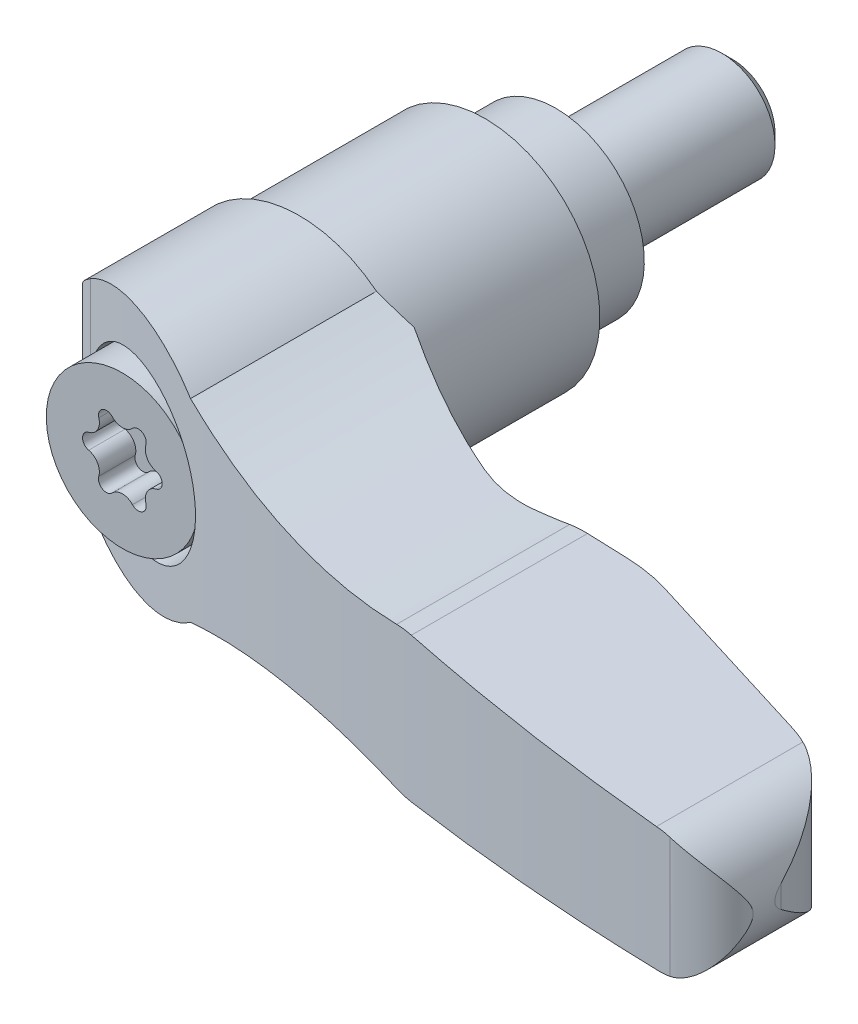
ISO-10303-21;
HEADER;
FILE_DESCRIPTION(('STEP AP214'),'2;1');
FILE_NAME('part.step','',(''),(''),'','','');
FILE_SCHEMA(('AUTOMOTIVE_DESIGN { 1 0 10303 214 1 1 1 1 }'));
ENDSEC;
DATA;
#1=APPLICATION_CONTEXT('core data for automotive mechanical design processes');
#2=APPLICATION_PROTOCOL_DEFINITION('international standard','automotive_design',2000,#1);
#3=PRODUCT_CONTEXT('',#1,'mechanical');
#4=PRODUCT('Part','Part','',(#3));
#5=PRODUCT_RELATED_PRODUCT_CATEGORY('part','',(#4));
#6=PRODUCT_DEFINITION_FORMATION('','',#4);
#7=PRODUCT_DEFINITION_CONTEXT('part definition',#1,'design');
#8=PRODUCT_DEFINITION('design','',#6,#7);
#9=PRODUCT_DEFINITION_SHAPE('','',#8);
#10=(LENGTH_UNIT() NAMED_UNIT(*) SI_UNIT(.MILLI.,.METRE.));
#11=(NAMED_UNIT(*) PLANE_ANGLE_UNIT() SI_UNIT($,.RADIAN.));
#12=(NAMED_UNIT(*) SI_UNIT($,.STERADIAN.) SOLID_ANGLE_UNIT());
#13=UNCERTAINTY_MEASURE_WITH_UNIT(LENGTH_MEASURE(1.E-05),#10,'distance_accuracy_value','');
#14=(GEOMETRIC_REPRESENTATION_CONTEXT(3) GLOBAL_UNCERTAINTY_ASSIGNED_CONTEXT((#13)) GLOBAL_UNIT_ASSIGNED_CONTEXT((#10,
#11,#12)) REPRESENTATION_CONTEXT('',''));
#15=CARTESIAN_POINT('',(0.,0.,0.));
#16=DIRECTION('',(0.,0.,1.));
#17=DIRECTION('',(1.,0.,0.));
#18=AXIS2_PLACEMENT_3D('',#15,#16,#17);
#19=CARTESIAN_POINT('',(1.1928325,0.,-10.));
#20=DIRECTION('',(0.,0.,-1.));
#21=DIRECTION('',(0.,1.,0.));
#22=AXIS2_PLACEMENT_3D('',#19,#20,#21);
#23=PLANE('',#22);
#24=CARTESIAN_POINT('',(0.,0.,-9.99999999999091));
#25=DIRECTION('',(0.,0.,1.));
#26=DIRECTION('',(0.,-1.,0.));
#27=AXIS2_PLACEMENT_3D('',#24,#25,#26);
#28=CIRCLE('',#27,2.38566499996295);
#29=CARTESIAN_POINT('',(0.,-2.38566499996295,-9.99999999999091));
#30=VERTEX_POINT('',#29);
#31=EDGE_CURVE('E633',#30,#30,#28,.T.);
#32=ORIENTED_EDGE('',*,*,#31,.F.);
#33=EDGE_LOOP('',(#32));
#34=FACE_BOUND('',#33,.T.);
#35=ADVANCED_FACE('F14',(#34),#23,.T.);
#36=CARTESIAN_POINT('',(0.,0.,-9.38566499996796));
#37=DIRECTION('',(0.,0.,1.));
#38=DIRECTION('',(0.,-1.,0.));
#39=AXIS2_PLACEMENT_3D('',#36,#37,#38);
#40=CONICAL_SURFACE('',#39,2.99999999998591,0.785398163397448);
#41=CARTESIAN_POINT('',(0.,0.,-9.385665));
#42=DIRECTION('',(0.,0.,-1.));
#43=DIRECTION('',(0.,1.,0.));
#44=AXIS2_PLACEMENT_3D('',#41,#42,#43);
#45=CIRCLE('',#44,3.);
#46=CARTESIAN_POINT('',(0.,3.,-9.385665));
#47=VERTEX_POINT('',#46);
#48=EDGE_CURVE('E563',#47,#47,#45,.F.);
#49=ORIENTED_EDGE('',*,*,#48,.F.);
#50=EDGE_LOOP('',(#49));
#51=FACE_BOUND('',#50,.T.);
#52=ORIENTED_EDGE('',*,*,#31,.T.);
#53=EDGE_LOOP('',(#52));
#54=FACE_BOUND('',#53,.T.);
#55=ADVANCED_FACE('F786',(#51,#54),#40,.T.);
#56=CARTESIAN_POINT('',(0.,0.,-4.6928325));
#57=DIRECTION('',(0.,0.,-1.));
#58=DIRECTION('',(0.,1.,0.));
#59=AXIS2_PLACEMENT_3D('',#56,#57,#58);
#60=CYLINDRICAL_SURFACE('',#59,3.);
#61=CARTESIAN_POINT('',(0.,0.,0.));
#62=DIRECTION('',(0.,0.,-1.));
#63=DIRECTION('',(0.,1.,0.));
#64=AXIS2_PLACEMENT_3D('',#61,#62,#63);
#65=CIRCLE('',#64,3.);
#66=CARTESIAN_POINT('',(0.,3.,0.));
#67=VERTEX_POINT('',#66);
#68=EDGE_CURVE('E559',#67,#67,#65,.F.);
#69=ORIENTED_EDGE('',*,*,#68,.F.);
#70=EDGE_LOOP('',(#69));
#71=FACE_BOUND('',#70,.T.);
#72=ORIENTED_EDGE('',*,*,#48,.T.);
#73=EDGE_LOOP('',(#72));
#74=FACE_BOUND('',#73,.T.);
#75=ADVANCED_FACE('F777',(#71,#74),#60,.T.);
#76=CARTESIAN_POINT('',(4.,0.,0.));
#77=DIRECTION('',(0.,0.,-1.));
#78=DIRECTION('',(0.,1.,0.));
#79=AXIS2_PLACEMENT_3D('',#76,#77,#78);
#80=PLANE('',#79);
#81=ORIENTED_EDGE('',*,*,#68,.T.);
#82=EDGE_LOOP('',(#81));
#83=FACE_BOUND('',#82,.T.);
#84=CARTESIAN_POINT('',(0.,0.,0.));
#85=DIRECTION('',(0.,0.,-1.));
#86=DIRECTION('',(0.,1.,0.));
#87=AXIS2_PLACEMENT_3D('',#84,#85,#86);
#88=CIRCLE('',#87,5.);
#89=CARTESIAN_POINT('',(0.,5.,0.));
#90=VERTEX_POINT('',#89);
#91=EDGE_CURVE('E652',#90,#90,#88,.F.);
#92=ORIENTED_EDGE('',*,*,#91,.F.);
#93=EDGE_LOOP('',(#92));
#94=FACE_BOUND('',#93,.T.);
#95=ADVANCED_FACE('F769',(#83,#94),#80,.T.);
#96=CARTESIAN_POINT('',(0.,0.,6.4));
#97=DIRECTION('',(0.,0.,-1.));
#98=DIRECTION('',(0.,1.,0.));
#99=AXIS2_PLACEMENT_3D('',#96,#97,#98);
#100=CYLINDRICAL_SURFACE('',#99,5.);
#101=ORIENTED_EDGE('',*,*,#91,.T.);
#102=EDGE_LOOP('',(#101));
#103=FACE_BOUND('',#102,.T.);
#104=CARTESIAN_POINT('',(0.,0.,4.55000000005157));
#105=DIRECTION('',(0.,0.,-1.));
#106=DIRECTION('',(1.,0.,0.));
#107=AXIS2_PLACEMENT_3D('',#104,#105,#106);
#108=CIRCLE('',#107,4.99999999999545);
#109=CARTESIAN_POINT('',(4.99999999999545,0.,4.55000000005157));
#110=VERTEX_POINT('',#109);
#111=EDGE_CURVE('E552',#110,#110,#108,.T.);
#112=ORIENTED_EDGE('',*,*,#111,.T.);
#113=EDGE_LOOP('',(#112));
#114=FACE_BOUND('',#113,.T.);
#115=ADVANCED_FACE('F761',(#103,#114),#100,.T.);
#116=CARTESIAN_POINT('',(0.,0.,4.30000000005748));
#117=DIRECTION('',(0.,0.,-1.));
#118=DIRECTION('',(0.,1.,0.));
#119=AXIS2_PLACEMENT_3D('',#116,#117,#118);
#120=CONICAL_SURFACE('',#119,5.24999999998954,0.785398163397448);
#121=ORIENTED_EDGE('',*,*,#111,.F.);
#122=EDGE_LOOP('',(#121));
#123=FACE_BOUND('',#122,.T.);
#124=CARTESIAN_POINT('',(0.,0.,4.3));
#125=DIRECTION('',(0.,0.,-1.));
#126=DIRECTION('',(0.,1.,0.));
#127=AXIS2_PLACEMENT_3D('',#124,#125,#126);
#128=CIRCLE('',#127,5.25);
#129=CARTESIAN_POINT('',(0.,5.25,4.3));
#130=VERTEX_POINT('',#129);
#131=EDGE_CURVE('E548',#130,#130,#128,.T.);
#132=ORIENTED_EDGE('',*,*,#131,.T.);
#133=EDGE_LOOP('',(#132));
#134=FACE_BOUND('',#133,.T.);
#135=ADVANCED_FACE('F757',(#123,#134),#120,.F.);
#136=CARTESIAN_POINT('',(0.,0.,3.65));
#137=DIRECTION('',(0.,0.,-1.));
#138=DIRECTION('',(0.,1.,0.));
#139=AXIS2_PLACEMENT_3D('',#136,#137,#138);
#140=CYLINDRICAL_SURFACE('',#139,5.25);
#141=ORIENTED_EDGE('',*,*,#131,.F.);
#142=EDGE_LOOP('',(#141));
#143=FACE_BOUND('',#142,.T.);
#144=CARTESIAN_POINT('',(0.,0.,4.));
#145=DIRECTION('',(0.,0.,-1.));
#146=DIRECTION('',(0.,1.,0.));
#147=AXIS2_PLACEMENT_3D('',#144,#145,#146);
#148=CIRCLE('',#147,5.25);
#149=CARTESIAN_POINT('',(0.,5.25,4.));
#150=VERTEX_POINT('',#149);
#151=EDGE_CURVE('E658',#150,#150,#148,.F.);
#152=ORIENTED_EDGE('',*,*,#151,.F.);
#153=EDGE_LOOP('',(#152));
#154=FACE_BOUND('',#153,.T.);
#155=ADVANCED_FACE('F749',(#143,#154),#140,.F.);
#156=CARTESIAN_POINT('',(-6.36002265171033,-14.,4.));
#157=DIRECTION('',(0.707106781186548,0.,0.707106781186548));
#158=DIRECTION('',(-0.707106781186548,0.,0.707106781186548));
#159=AXIS2_PLACEMENT_3D('',#156,#157,#158);
#160=PLANE('',#159);
#161=DIRECTION('',(0.,1.,0.));
#162=VECTOR('',#161,1.);
#163=CARTESIAN_POINT('',(-6.36002265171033,0.,4.));
#164=LINE('',#163,#162);
#165=CARTESIAN_POINT('',(-6.36002265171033,-1.38824072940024,4.));
#166=VERTEX_POINT('',#165);
#167=CARTESIAN_POINT('',(-6.36002265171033,1.38824072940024,4.));
#168=VERTEX_POINT('',#167);
#169=EDGE_CURVE('E661',#166,#168,#164,.T.);
#170=ORIENTED_EDGE('',*,*,#169,.F.);
#171=CARTESIAN_POINT('',(-0.0100000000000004,0.,-2.35002265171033));
#172=DIRECTION('',(0.707106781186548,0.,0.707106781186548));
#173=DIRECTION('',(-0.707106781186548,0.,0.707106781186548));
#174=AXIS2_PLACEMENT_3D('',#171,#172,#173);
#175=ELLIPSE('',#174,9.19238815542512,6.5);
#176=EDGE_CURVE('E551',#168,#166,#175,.T.);
#177=ORIENTED_EDGE('',*,*,#176,.F.);
#178=EDGE_LOOP('',(#170,#177));
#179=FACE_BOUND('',#178,.T.);
#180=ADVANCED_FACE('F744',(#179),#160,.F.);
#181=CARTESIAN_POINT('',(-3.26,0.,4.));
#182=DIRECTION('',(0.,0.,-1.));
#183=DIRECTION('',(0.,1.,0.));
#184=AXIS2_PLACEMENT_3D('',#181,#182,#183);
#185=PLANE('',#184);
#186=CARTESIAN_POINT('',(-0.0100000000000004,0.,4.));
#187=DIRECTION('',(0.,0.,1.));
#188=DIRECTION('',(-1.,0.,0.));
#189=AXIS2_PLACEMENT_3D('',#186,#187,#188);
#190=CIRCLE('',#189,6.5);
#191=EDGE_CURVE('E667',#166,#168,#190,.T.);
#192=ORIENTED_EDGE('',*,*,#191,.F.);
#193=ORIENTED_EDGE('',*,*,#169,.T.);
#194=EDGE_LOOP('',(#192,#193));
#195=FACE_BOUND('',#194,.T.);
#196=ORIENTED_EDGE('',*,*,#151,.T.);
#197=EDGE_LOOP('',(#196));
#198=FACE_BOUND('',#197,.T.);
#199=ADVANCED_FACE('F740',(#195,#198),#185,.T.);
#200=CARTESIAN_POINT('',(39.9389658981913,-8.,27.2042491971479));
#201=DIRECTION('',(0.989626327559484,0.,-0.143665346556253));
#202=DIRECTION('',(0.143665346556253,0.,0.989626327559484));
#203=AXIS2_PLACEMENT_3D('',#200,#201,#202);
#204=PLANE('',#203);
#205=CARTESIAN_POINT('',(36.5,0.,3.51522972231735));
#206=DIRECTION('',(0.989626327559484,0.,-0.143665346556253));
#207=DIRECTION('',(0.143665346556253,0.,0.989626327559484));
#208=AXIS2_PLACEMENT_3D('',#205,#206,#207);
#209=ELLIPSE('',#208,24.3621728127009,3.5);
#210=CARTESIAN_POINT('',(39.9389658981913,-0.650779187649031,27.2042491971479));
#211=VERTEX_POINT('',#210);
#212=CARTESIAN_POINT('',(39.9389658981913,0.650779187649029,27.2042491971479));
#213=VERTEX_POINT('',#212);
#214=EDGE_CURVE('E459',#211,#213,#209,.F.);
#215=ORIENTED_EDGE('',*,*,#214,.F.);
#216=DIRECTION('',(0.,-1.,0.));
#217=VECTOR('',#216,1.);
#218=CARTESIAN_POINT('',(39.9389658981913,-8.,27.2042491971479));
#219=LINE('',#218,#217);
#220=EDGE_CURVE('E666',#213,#211,#219,.T.);
#221=ORIENTED_EDGE('',*,*,#220,.F.);
#222=EDGE_LOOP('',(#215,#221));
#223=FACE_BOUND('',#222,.T.);
#224=ADVANCED_FACE('F483',(#223),#204,.T.);
#225=CARTESIAN_POINT('',(33.8626602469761,-8.,28.0863544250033));
#226=DIRECTION('',(0.,-1.,0.));
#227=DIRECTION('',(1.,0.,0.));
#228=AXIS2_PLACEMENT_3D('',#225,#226,#227);
#229=CYLINDRICAL_SURFACE('',#228,6.14);
#230=ORIENTED_EDGE('',*,*,#220,.T.);
#231=CARTESIAN_POINT('',(36.5,-3.5,22.5416236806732));
#232=CARTESIAN_POINT('',(36.6061539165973,-3.50000941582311,22.5920863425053));
#233=CARTESIAN_POINT('',(36.7107657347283,-3.49517280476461,22.6456099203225));
#234=CARTESIAN_POINT('',(36.9160027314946,-3.47671082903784,22.758101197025));
#235=CARTESIAN_POINT('',(37.0166343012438,-3.46310021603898,22.8170596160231));
#236=CARTESIAN_POINT('',(37.2123479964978,-3.42816986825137,22.9392782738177));
#237=CARTESIAN_POINT('',(37.3074768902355,-3.40693163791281,23.002487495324));
#238=CARTESIAN_POINT('',(37.4929223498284,-3.3575759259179,23.13320682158));
#239=CARTESIAN_POINT('',(37.5832363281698,-3.32945478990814,23.200719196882));
#240=CARTESIAN_POINT('',(37.7830795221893,-3.25850520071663,23.3587409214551));
#241=CARTESIAN_POINT('',(37.8909927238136,-3.21376078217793,23.4504360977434));
#242=CARTESIAN_POINT('',(38.0982482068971,-3.1158868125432,23.6389903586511));
#243=CARTESIAN_POINT('',(38.1975840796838,-3.0627510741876,23.7358532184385));
#244=CARTESIAN_POINT('',(38.3880468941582,-2.94917464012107,23.9343090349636));
#245=CARTESIAN_POINT('',(38.4791322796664,-2.88870020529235,24.0359224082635));
#246=CARTESIAN_POINT('',(38.6526412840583,-2.76182607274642,24.2426721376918));
#247=CARTESIAN_POINT('',(38.7350674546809,-2.69542813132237,24.3478074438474));
#248=CARTESIAN_POINT('',(38.9229341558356,-2.52996933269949,24.6038856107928));
#249=CARTESIAN_POINT('',(39.0243159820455,-2.42850340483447,24.7562617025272));
#250=CARTESIAN_POINT('',(39.2111706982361,-2.21796613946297,25.0654781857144));
#251=CARTESIAN_POINT('',(39.2966363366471,-2.10889136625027,25.2223205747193));
#252=CARTESIAN_POINT('',(39.452222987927,-1.88493092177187,25.5392893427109));
#253=CARTESIAN_POINT('',(39.5223498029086,-1.77004746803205,25.699414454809));
#254=CARTESIAN_POINT('',(39.6478320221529,-1.53583460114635,26.0220530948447));
#255=CARTESIAN_POINT('',(39.7031929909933,-1.41650688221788,26.1845656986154));
#256=CARTESIAN_POINT('',(39.7933776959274,-1.1901857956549,26.4900634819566));
#257=CARTESIAN_POINT('',(39.8299343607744,-1.08360162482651,26.6328455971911));
#258=CARTESIAN_POINT('',(39.8923391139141,-0.868586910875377,26.918504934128));
#259=CARTESIAN_POINT('',(39.918226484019,-0.760164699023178,27.0613798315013));
#260=CARTESIAN_POINT('',(39.9389658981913,-0.650779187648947,27.204249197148));
#261=B_SPLINE_CURVE_WITH_KNOTS('',3,(#231,#232,#233,#234,#235,#236,#237,#238,#239,#240,#241,
#242,#243,#244,#245,#246,#247,#248,#249,#250,#251,#252,#253,#254,#255,#256,#257,#258,#259,#260),
.UNSPECIFIED.,.F.,.F.,(4,2,2,2,2,2,2,2,2,2,2,2,2,2,4),(0.,0.352350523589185,0.704110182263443,
1.05221781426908,1.40051067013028,1.84538152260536,2.29058194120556,2.73791274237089,
3.18511134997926,3.81198117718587,4.43913591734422,5.06605301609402,5.69273352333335,
6.23807905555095,6.78139842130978),.UNSPECIFIED.);
#262=CARTESIAN_POINT('',(36.5,-3.5,22.5416236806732));
#263=VERTEX_POINT('',#262);
#264=EDGE_CURVE('E463',#263,#211,#261,.T.);
#265=ORIENTED_EDGE('',*,*,#264,.F.);
#266=CARTESIAN_POINT('',(33.8626602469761,-3.59762871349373,28.0863544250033));
#267=DIRECTION('',(-0.0369925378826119,0.999315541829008,0.));
#268=DIRECTION('',(-0.999315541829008,-0.0369925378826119,0.));
#269=AXIS2_PLACEMENT_3D('',#266,#267,#268);
#270=ELLIPSE('',#269,6.14420545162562,6.14);
#271=CARTESIAN_POINT('',(35.5344609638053,-3.53574220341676,22.1783359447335));
#272=VERTEX_POINT('',#271);
#273=EDGE_CURVE('E662',#263,#272,#270,.T.);
#274=ORIENTED_EDGE('',*,*,#273,.T.);
#275=DIRECTION('',(0.,-1.,0.));
#276=VECTOR('',#275,1.);
#277=CARTESIAN_POINT('',(35.5344609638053,-8.,22.1783359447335));
#278=LINE('',#277,#276);
#279=CARTESIAN_POINT('',(35.5344609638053,3.53574220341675,22.1783359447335));
#280=VERTEX_POINT('',#279);
#281=EDGE_CURVE('E533',#280,#272,#278,.T.);
#282=ORIENTED_EDGE('',*,*,#281,.F.);
#283=CARTESIAN_POINT('',(33.8626602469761,3.59762871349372,28.0863544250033));
#284=DIRECTION('',(-0.036992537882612,-0.999315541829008,0.));
#285=DIRECTION('',(0.999315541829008,-0.036992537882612,0.));
#286=AXIS2_PLACEMENT_3D('',#283,#284,#285);
#287=ELLIPSE('',#286,6.14420545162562,6.14);
#288=CARTESIAN_POINT('',(36.5,3.5,22.5416236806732));
#289=VERTEX_POINT('',#288);
#290=EDGE_CURVE('E664',#280,#289,#287,.T.);
#291=ORIENTED_EDGE('',*,*,#290,.T.);
#292=CARTESIAN_POINT('',(39.9389658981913,0.65077918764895,27.204249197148));
#293=CARTESIAN_POINT('',(39.9247028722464,0.726086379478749,27.1059853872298));
#294=CARTESIAN_POINT('',(39.9079968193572,0.800887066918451,27.0076860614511));
#295=CARTESIAN_POINT('',(39.8696347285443,0.949458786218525,26.8112602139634));
#296=CARTESIAN_POINT('',(39.8479781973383,1.02322971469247,26.7131337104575));
#297=CARTESIAN_POINT('',(39.7995979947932,1.169880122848,26.5170899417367));
#298=CARTESIAN_POINT('',(39.7728626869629,1.24275713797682,26.4191736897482));
#299=CARTESIAN_POINT('',(39.7142815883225,1.38725410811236,26.2239599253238));
#300=CARTESIAN_POINT('',(39.6824358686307,1.4588740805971,26.1266624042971));
#301=CARTESIAN_POINT('',(39.5782917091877,1.67318502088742,25.8337016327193));
#302=CARTESIAN_POINT('',(39.4979263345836,1.81366367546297,25.6391889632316));
#303=CARTESIAN_POINT('',(39.3150854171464,2.08619457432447,25.2551202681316));
#304=CARTESIAN_POINT('',(39.2126344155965,2.218255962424,25.0655590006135));
#305=CARTESIAN_POINT('',(38.9595027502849,2.49877334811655,24.6523338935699));
#306=CARTESIAN_POINT('',(38.8031801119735,2.64456339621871,24.4302018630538));
#307=CARTESIAN_POINT('',(38.5417124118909,2.84488994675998,24.1082756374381));
#308=CARTESIAN_POINT('',(38.4501831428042,2.90854134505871,24.0029632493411));
#309=CARTESIAN_POINT('',(38.2579442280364,3.02861213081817,23.7967186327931));
#310=CARTESIAN_POINT('',(38.1572360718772,3.08503268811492,23.6957856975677));
#311=CARTESIAN_POINT('',(37.8892625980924,3.21757634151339,23.4457323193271));
#312=CARTESIAN_POINT('',(37.7155213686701,3.28779061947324,23.3001643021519));
#313=CARTESIAN_POINT('',(37.4396992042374,3.37286339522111,23.0946053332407));
#314=CARTESIAN_POINT('',(37.3453175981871,3.39783246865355,23.0282732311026));
#315=CARTESIAN_POINT('',(37.1517842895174,3.44019984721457,22.9003457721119));
#316=CARTESIAN_POINT('',(37.0526354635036,3.45760265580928,22.8387476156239));
#317=CARTESIAN_POINT('',(36.8781783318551,3.48029211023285,22.7372021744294));
#318=CARTESIAN_POINT('',(36.8038676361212,3.48759914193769,22.6959814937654));
#319=CARTESIAN_POINT('',(36.6533047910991,3.497455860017,22.6165121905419));
#320=CARTESIAN_POINT('',(36.5770513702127,3.50000234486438,22.5782655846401));
#321=CARTESIAN_POINT('',(36.5,3.5,22.5416236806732));
#322=B_SPLINE_CURVE_WITH_KNOTS('',3,(#292,#293,#294,#295,#296,#297,#298,#299,#300,#301,#302,
#303,#304,#305,#306,#307,#308,#309,#310,#311,#312,#313,#314,#315,#316,#317,#318,#319,#320,#321),
.UNSPECIFIED.,.F.,.F.,(4,2,2,2,2,2,2,2,2,2,2,2,2,2,4),(0.,0.373839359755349,0.74771598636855,
1.12245980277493,1.49719840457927,2.25512351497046,3.01221072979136,3.93367725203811,
4.39332639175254,4.85290107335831,5.56171222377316,5.91546495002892,6.26900683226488,
6.52468766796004,6.78054039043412),.UNSPECIFIED.);
#323=EDGE_CURVE('E432',#213,#289,#322,.T.);
#324=ORIENTED_EDGE('',*,*,#323,.F.);
#325=EDGE_LOOP('',(#230,#265,#274,#282,#291,#324));
#326=FACE_BOUND('',#325,.T.);
#327=ADVANCED_FACE('F477',(#326),#229,.T.);
#328=CARTESIAN_POINT('',(-0.0100000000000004,0.,10.28125));
#329=DIRECTION('',(0.,0.,1.));
#330=DIRECTION('',(-1.,0.,0.));
#331=AXIS2_PLACEMENT_3D('',#328,#329,#330);
#332=CYLINDRICAL_SURFACE('',#331,6.5);
#333=CARTESIAN_POINT('',(-0.0100000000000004,0.,14.5));
#334=DIRECTION('',(0.,0.,1.));
#335=DIRECTION('',(-1.,0.,0.));
#336=AXIS2_PLACEMENT_3D('',#333,#334,#335);
#337=CIRCLE('',#336,6.5);
#338=CARTESIAN_POINT('',(-6.51,0.,14.5));
#339=VERTEX_POINT('',#338);
#340=CARTESIAN_POINT('',(6.49,0.,14.5));
#341=VERTEX_POINT('',#340);
#342=EDGE_CURVE('E669',#339,#341,#337,.T.);
#343=ORIENTED_EDGE('',*,*,#342,.F.);
#344=CARTESIAN_POINT('',(-0.0100000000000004,0.,14.5));
#345=DIRECTION('',(0.,0.,1.));
#346=DIRECTION('',(-1.,0.,0.));
#347=AXIS2_PLACEMENT_3D('',#344,#345,#346);
#348=CIRCLE('',#347,6.5);
#349=EDGE_CURVE('E530',#341,#339,#348,.T.);
#350=ORIENTED_EDGE('',*,*,#349,.F.);
#351=EDGE_LOOP('',(#343,#350));
#352=FACE_BOUND('',#351,.T.);
#353=ORIENTED_EDGE('',*,*,#191,.T.);
#354=ORIENTED_EDGE('',*,*,#176,.T.);
#355=EDGE_LOOP('',(#353,#354));
#356=FACE_BOUND('',#355,.T.);
#357=ADVANCED_FACE('F482',(#352,#356),#332,.T.);
#358=CARTESIAN_POINT('',(-6.51,-8.,14.5));
#359=DIRECTION('',(0.,0.,-1.));
#360=DIRECTION('',(0.,1.,0.));
#361=AXIS2_PLACEMENT_3D('',#358,#359,#360);
#362=PLANE('',#361);
#363=ORIENTED_EDGE('',*,*,#342,.T.);
#364=DIRECTION('',(0.,-1.,0.));
#365=VECTOR('',#364,1.);
#366=CARTESIAN_POINT('',(6.49,-8.,14.5));
#367=LINE('',#366,#365);
#368=CARTESIAN_POINT('',(6.49,-4.77390244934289,14.5));
#369=VERTEX_POINT('',#368);
#370=EDGE_CURVE('E1148',#341,#369,#367,.T.);
#371=ORIENTED_EDGE('',*,*,#370,.T.);
#372=CARTESIAN_POINT('',(14.8,-33.6,14.5));
#373=DIRECTION('',(0.,0.,1.));
#374=DIRECTION('',(0.,-1.,0.));
#375=AXIS2_PLACEMENT_3D('',#372,#373,#374);
#376=CIRCLE('',#375,30.);
#377=CARTESIAN_POINT('',(4.36278582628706,-5.47413005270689,14.5));
#378=VERTEX_POINT('',#377);
#379=EDGE_CURVE('E706',#369,#378,#376,.T.);
#380=ORIENTED_EDGE('',*,*,#379,.T.);
#381=CARTESIAN_POINT('',(0.,0.,14.5));
#382=DIRECTION('',(0.,0.,1.));
#383=DIRECTION('',(0.,-1.,0.));
#384=AXIS2_PLACEMENT_3D('',#381,#382,#383);
#385=CIRCLE('',#384,7.);
#386=CARTESIAN_POINT('',(-6.51,-2.57291663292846,14.5));
#387=VERTEX_POINT('',#386);
#388=EDGE_CURVE('E370',#387,#378,#385,.T.);
#389=ORIENTED_EDGE('',*,*,#388,.F.);
#390=DIRECTION('',(0.,-1.,0.));
#391=VECTOR('',#390,1.);
#392=CARTESIAN_POINT('',(-6.51,-8.,14.5));
#393=LINE('',#392,#391);
#394=EDGE_CURVE('E529',#339,#387,#393,.T.);
#395=ORIENTED_EDGE('',*,*,#394,.F.);
#396=EDGE_LOOP('',(#363,#371,#380,#389,#395));
#397=FACE_BOUND('',#396,.T.);
#398=ADVANCED_FACE('F488',(#397),#362,.T.);
#399=CARTESIAN_POINT('',(20.6060580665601,0.915064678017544,31.));
#400=DIRECTION('',(0.,0.,1.));
#401=DIRECTION('',(0.,-1.,0.));
#402=AXIS2_PLACEMENT_3D('',#399,#400,#401);
#403=CYLINDRICAL_SURFACE('',#402,5.);
#404=CARTESIAN_POINT('',(20.7910207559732,-4.08151303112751,28.9575923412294));
#405=CARTESIAN_POINT('',(20.6207575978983,-4.08776311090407,28.9275070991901));
#406=CARTESIAN_POINT('',(20.4510927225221,-4.08540030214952,28.8972050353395));
#407=CARTESIAN_POINT('',(20.1129595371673,-4.06344890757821,28.8361672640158));
#408=CARTESIAN_POINT('',(19.9444912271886,-4.04386032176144,28.8054315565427));
#409=CARTESIAN_POINT('',(19.7766211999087,-4.01565884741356,28.7744790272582));
#410=B_SPLINE_CURVE_WITH_KNOTS('',3,(#404,#405,#406,#407,#408,#409),.UNSPECIFIED.,.F.,.F.,(4,2,
4),(0.,0.517097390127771,1.03419478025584),.UNSPECIFIED.);
#411=CARTESIAN_POINT('',(20.7910207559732,-4.08151303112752,28.9575923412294));
#412=VERTEX_POINT('',#411);
#413=CARTESIAN_POINT('',(19.7766211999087,-4.01565884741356,28.7744790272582));
#414=VERTEX_POINT('',#413);
#415=EDGE_CURVE('E466',#412,#414,#410,.T.);
#416=ORIENTED_EDGE('',*,*,#415,.T.);
#417=DIRECTION('',(0.,0.,1.));
#418=VECTOR('',#417,1.);
#419=CARTESIAN_POINT('',(19.7766211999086,-4.01565884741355,31.));
#420=LINE('',#419,#418);
#421=CARTESIAN_POINT('',(19.7766211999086,-4.01565884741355,19.));
#422=VERTEX_POINT('',#421);
#423=EDGE_CURVE('E674',#414,#422,#420,.F.);
#424=ORIENTED_EDGE('',*,*,#423,.T.);
#425=CARTESIAN_POINT('',(20.6060580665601,0.915064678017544,19.));
#426=DIRECTION('',(0.,0.,1.));
#427=DIRECTION('',(0.,-1.,0.));
#428=AXIS2_PLACEMENT_3D('',#425,#426,#427);
#429=CIRCLE('',#428,5.);
#430=CARTESIAN_POINT('',(20.7910207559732,-4.08151303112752,19.));
#431=VERTEX_POINT('',#430);
#432=EDGE_CURVE('E1141',#431,#422,#429,.F.);
#433=ORIENTED_EDGE('',*,*,#432,.F.);
#434=DIRECTION('',(0.,0.,1.));
#435=VECTOR('',#434,1.);
#436=CARTESIAN_POINT('',(20.7910207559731,-4.08151303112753,31.));
#437=LINE('',#436,#435);
#438=EDGE_CURVE('E677',#431,#412,#437,.T.);
#439=ORIENTED_EDGE('',*,*,#438,.T.);
#440=EDGE_LOOP('',(#416,#424,#433,#439));
#441=FACE_BOUND('',#440,.T.);
#442=ADVANCED_FACE('F424',(#441),#403,.T.);
#443=CARTESIAN_POINT('',(36.5,0.,31.));
#444=DIRECTION('',(0.,0.,1.));
#445=DIRECTION('',(0.,-1.,0.));
#446=AXIS2_PLACEMENT_3D('',#443,#444,#445);
#447=CYLINDRICAL_SURFACE('',#446,3.5);
#448=CARTESIAN_POINT('',(37.3240183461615,-3.40161634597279,30.8631619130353));
#449=CARTESIAN_POINT('',(37.188603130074,-3.43435641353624,30.8557619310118));
#450=CARTESIAN_POINT('',(37.0522273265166,-3.45892508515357,30.8481012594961));
#451=CARTESIAN_POINT('',(36.7775545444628,-3.49171963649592,30.8322585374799));
#452=CARTESIAN_POINT('',(36.6392575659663,-3.499945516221,30.8240764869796));
#453=CARTESIAN_POINT('',(36.5,-3.5,30.815633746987));
#454=B_SPLINE_CURVE_WITH_KNOTS('',3,(#448,#449,#450,#451,#452,#453),.UNSPECIFIED.,.F.,.F.,(4,2,
4),(0.,0.416348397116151,0.832696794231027),.UNSPECIFIED.);
#455=CARTESIAN_POINT('',(37.3240183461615,-3.40161634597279,30.8631619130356));
#456=VERTEX_POINT('',#455);
#457=CARTESIAN_POINT('',(36.5,-3.5,30.815633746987));
#458=VERTEX_POINT('',#457);
#459=EDGE_CURVE('E444',#456,#458,#454,.T.);
#460=ORIENTED_EDGE('',*,*,#459,.T.);
#461=DIRECTION('',(0.,0.,1.));
#462=VECTOR('',#461,1.);
#463=CARTESIAN_POINT('',(36.5,-3.5,31.));
#464=LINE('',#463,#462);
#465=EDGE_CURVE('E712',#458,#263,#464,.F.);
#466=ORIENTED_EDGE('',*,*,#465,.T.);
#467=ORIENTED_EDGE('',*,*,#264,.T.);
#468=ORIENTED_EDGE('',*,*,#214,.T.);
#469=ORIENTED_EDGE('',*,*,#323,.T.);
#470=DIRECTION('',(0.,0.,1.));
#471=VECTOR('',#470,1.);
#472=CARTESIAN_POINT('',(36.5,3.5,31.));
#473=LINE('',#472,#471);
#474=CARTESIAN_POINT('',(36.5,3.5,30.815633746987));
#475=VERTEX_POINT('',#474);
#476=EDGE_CURVE('E412',#289,#475,#473,.T.);
#477=ORIENTED_EDGE('',*,*,#476,.T.);
#478=CARTESIAN_POINT('',(36.5,3.5,30.815633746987));
#479=CARTESIAN_POINT('',(36.6392575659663,3.499945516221,30.8240764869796));
#480=CARTESIAN_POINT('',(36.7775545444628,3.49171963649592,30.8322585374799));
#481=CARTESIAN_POINT('',(37.0522273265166,3.45892508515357,30.8481012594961));
#482=CARTESIAN_POINT('',(37.188603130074,3.43435641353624,30.8557619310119));
#483=CARTESIAN_POINT('',(37.3240183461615,3.40161634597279,30.8631619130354));
#484=B_SPLINE_CURVE_WITH_KNOTS('',3,(#478,#479,#480,#481,#482,#483),.UNSPECIFIED.,.F.,.F.,(4,2,
4),(0.,0.416348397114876,0.83269679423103),.UNSPECIFIED.);
#485=CARTESIAN_POINT('',(37.3240183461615,3.40161634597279,30.8631619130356));
#486=VERTEX_POINT('',#485);
#487=EDGE_CURVE('E450',#475,#486,#484,.T.);
#488=ORIENTED_EDGE('',*,*,#487,.T.);
#489=CARTESIAN_POINT('',(37.3240183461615,-3.40161634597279,30.8631619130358));
#490=CARTESIAN_POINT('',(37.391971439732,-3.38517327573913,30.8668921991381));
#491=CARTESIAN_POINT('',(37.4595366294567,-3.36663320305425,30.8678982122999));
#492=CARTESIAN_POINT('',(37.5932555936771,-3.32560440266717,30.8647814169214));
#493=CARTESIAN_POINT('',(37.6594109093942,-3.30312026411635,30.8606645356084));
#494=CARTESIAN_POINT('',(37.7892420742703,-3.25463078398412,30.8476880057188));
#495=CARTESIAN_POINT('',(37.8529349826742,-3.22865926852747,30.8388717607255));
#496=CARTESIAN_POINT('',(37.9780608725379,-3.17332967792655,30.8169101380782));
#497=CARTESIAN_POINT('',(38.0394932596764,-3.14397072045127,30.8037636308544));
#498=CARTESIAN_POINT('',(38.2193405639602,-3.05154774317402,30.7585650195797));
#499=CARTESIAN_POINT('',(38.3339861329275,-2.98387991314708,30.7206782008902));
#500=CARTESIAN_POINT('',(38.5517467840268,-2.83858348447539,30.6324207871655));
#501=CARTESIAN_POINT('',(38.6548343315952,-2.76093200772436,30.5820212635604));
#502=CARTESIAN_POINT('',(38.8266237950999,-2.61655584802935,30.4842690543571));
#503=CARTESIAN_POINT('',(38.8977926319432,-2.55140368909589,30.4388637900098));
#504=CARTESIAN_POINT('',(39.0330318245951,-2.41719472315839,30.3433991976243));
#505=CARTESIAN_POINT('',(39.0970985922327,-2.34813596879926,30.2933375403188));
#506=CARTESIAN_POINT('',(39.2184581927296,-2.20651617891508,30.1893556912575));
#507=CARTESIAN_POINT('',(39.2757265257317,-2.13394372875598,30.1354226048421));
#508=CARTESIAN_POINT('',(39.3834200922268,-1.98601495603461,30.0247265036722));
#509=CARTESIAN_POINT('',(39.4338475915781,-1.91065956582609,29.9679644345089));
#510=CARTESIAN_POINT('',(39.5424214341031,-1.73419420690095,29.8348143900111));
#511=CARTESIAN_POINT('',(39.598263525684,-1.63221056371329,29.7576996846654));
#512=CARTESIAN_POINT('',(39.699250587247,-1.42414609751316,29.601672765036));
#513=CARTESIAN_POINT('',(39.7443776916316,-1.31805876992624,29.5227577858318));
#514=CARTESIAN_POINT('',(39.8239747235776,-1.10201279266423,29.3659397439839));
#515=CARTESIAN_POINT('',(39.8584944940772,-0.992075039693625,29.2880336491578));
#516=CARTESIAN_POINT('',(39.9024720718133,-0.82253324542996,29.1754655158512));
#517=CARTESIAN_POINT('',(39.9158188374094,-0.765322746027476,29.13870216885));
#518=CARTESIAN_POINT('',(39.9398686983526,-0.648731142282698,29.0678855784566));
#519=CARTESIAN_POINT('',(39.9505741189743,-0.589352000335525,29.0338299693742));
#520=CARTESIAN_POINT('',(39.9677206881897,-0.477086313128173,28.9756719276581));
#521=CARTESIAN_POINT('',(39.974567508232,-0.424644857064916,28.9508463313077));
#522=CARTESIAN_POINT('',(39.9860225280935,-0.317100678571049,28.907341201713));
#523=CARTESIAN_POINT('',(39.9906385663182,-0.262008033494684,28.8886402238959));
#524=CARTESIAN_POINT('',(39.9966232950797,-0.160247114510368,28.8637621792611));
#525=CARTESIAN_POINT('',(39.9984523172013,-0.114054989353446,28.8558445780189));
#526=CARTESIAN_POINT('',(40.0002450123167,-0.0209847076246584,28.8480882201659));
#527=CARTESIAN_POINT('',(40.0002117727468,0.0258921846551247,28.8482360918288));
#528=CARTESIAN_POINT('',(39.9982952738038,0.118672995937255,28.8565205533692));
#529=CARTESIAN_POINT('',(39.9964185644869,0.164579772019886,28.8646288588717));
#530=CARTESIAN_POINT('',(39.9910078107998,0.254792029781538,28.8870889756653));
#531=CARTESIAN_POINT('',(39.9874686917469,0.299092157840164,28.9014598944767));
#532=CARTESIAN_POINT('',(39.9768286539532,0.407331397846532,28.9425912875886));
#533=CARTESIAN_POINT('',(39.9688318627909,0.470155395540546,28.9719647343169));
#534=CARTESIAN_POINT('',(39.9499914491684,0.592804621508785,29.0357410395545));
#535=CARTESIAN_POINT('',(39.9391403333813,0.652621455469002,29.0701570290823));
#536=CARTESIAN_POINT('',(39.9146680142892,0.770512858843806,29.1419527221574));
#537=CARTESIAN_POINT('',(39.9010255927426,0.828569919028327,29.1793537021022));
#538=CARTESIAN_POINT('',(39.8711029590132,0.942947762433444,29.2555520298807));
#539=CARTESIAN_POINT('',(39.8548256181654,0.999270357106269,29.2943478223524));
#540=CARTESIAN_POINT('',(39.8016739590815,1.1674299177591,29.4125134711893));
#541=CARTESIAN_POINT('',(39.7607265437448,1.27728939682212,29.4929030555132));
#542=CARTESIAN_POINT('',(39.6677865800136,1.49294867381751,29.6529500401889));
#543=CARTESIAN_POINT('',(39.6157834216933,1.59874445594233,29.7326066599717));
#544=CARTESIAN_POINT('',(39.5005966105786,1.80564912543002,29.8886982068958));
#545=CARTESIAN_POINT('',(39.4374685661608,1.90677830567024,29.9651469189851));
#546=CARTESIAN_POINT('',(39.2994325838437,2.10420227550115,30.1133265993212));
#547=CARTESIAN_POINT('',(39.2245348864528,2.20050117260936,30.1850615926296));
#548=CARTESIAN_POINT('',(39.0442952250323,2.40820732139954,30.3372677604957));
#549=CARTESIAN_POINT('',(38.9358891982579,2.51819093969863,30.4161164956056));
#550=CARTESIAN_POINT('',(38.7000552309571,2.72661786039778,30.559662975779));
#551=CARTESIAN_POINT('',(38.5726400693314,2.82506883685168,30.6243701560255));
#552=CARTESIAN_POINT('',(38.3254291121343,2.98922527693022,30.7237895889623));
#553=CARTESIAN_POINT('',(38.2087731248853,3.05759969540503,30.7618633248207));
#554=CARTESIAN_POINT('',(37.9650872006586,3.18151973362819,30.8217517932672));
#555=CARTESIAN_POINT('',(37.8380870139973,3.23710049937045,30.8436114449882));
#556=CARTESIAN_POINT('',(37.6449762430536,3.3080955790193,30.8616374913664));
#557=CARTESIAN_POINT('',(37.5816159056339,3.32934954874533,30.8652564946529));
#558=CARTESIAN_POINT('',(37.4536360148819,3.36824327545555,30.867801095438));
#559=CARTESIAN_POINT('',(37.389015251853,3.38587935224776,30.8667219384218));
#560=CARTESIAN_POINT('',(37.3240183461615,3.40161634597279,30.8631619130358));
#561=B_SPLINE_CURVE_WITH_KNOTS('',3,(#489,#490,#491,#492,#493,#494,#495,#496,#497,#498,#499,
#500,#501,#502,#503,#504,#505,#506,#507,#508,#509,#510,#511,#512,#513,#514,#515,#516,#517,#518,
#519,#520,#521,#522,#523,#524,#525,#526,#527,#528,#529,#530,#531,#532,#533,#534,#535,#536,#537,
#538,#539,#540,#541,#542,#543,#544,#545,#546,#547,#548,#549,#550,#551,#552,#553,#554,#555,#556,
#557,#558,#559,#560),.UNSPECIFIED.,.F.,.F.,(4,2,2,2,2,2,2,2,2,2,2,2,2,2,2,2,2,2,2,2,2,2,2,2,2,2,
2,2,2,2,2,2,2,2,2,4),(0.,0.209913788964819,0.419584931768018,0.627352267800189,
0.835173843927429,1.24864928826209,1.66308971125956,1.98257890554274,2.30222878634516,
2.62299771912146,2.94366014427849,3.36167065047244,3.78037330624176,4.19707731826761,
4.40489951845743,4.61253810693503,4.78756393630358,4.9619702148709,5.10204921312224,
5.24189598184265,5.38124764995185,5.52102749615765,5.72989301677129,5.93931243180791,
6.15038720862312,6.36123350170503,6.78715763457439,7.21349237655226,7.63775356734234,
8.06164764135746,8.58013018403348,9.09826573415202,9.51811060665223,9.9367879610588,
10.1373304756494,10.3380759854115),.UNSPECIFIED.);
#562=EDGE_CURVE('E404',#456,#486,#561,.T.);
#563=ORIENTED_EDGE('',*,*,#562,.F.);
#564=EDGE_LOOP('',(#460,#466,#467,#468,#469,#477,#488,#563));
#565=FACE_BOUND('',#564,.T.);
#566=ADVANCED_FACE('F418',(#565),#447,.T.);
#567=CARTESIAN_POINT('',(23.0466685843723,-8.,28.05));
#568=DIRECTION('',(0.,-1.,0.));
#569=DIRECTION('',(1.,0.,0.));
#570=AXIS2_PLACEMENT_3D('',#567,#568,#569);
#571=CYLINDRICAL_SURFACE('',#570,9.05000000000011);
#572=CARTESIAN_POINT('',(23.0466685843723,3.99801374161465,28.05));
#573=DIRECTION('',(-0.036992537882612,-0.999315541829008,0.));
#574=DIRECTION('',(0.999315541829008,-0.036992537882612,0.));
#575=AXIS2_PLACEMENT_3D('',#572,#573,#574);
#576=ELLIPSE('',#575,9.05619858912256,9.05000000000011);
#577=CARTESIAN_POINT('',(23.0466685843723,3.99801374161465,19.));
#578=VERTEX_POINT('',#577);
#579=CARTESIAN_POINT('',(25.5108048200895,3.90679665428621,19.34192715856));
#580=VERTEX_POINT('',#579);
#581=EDGE_CURVE('E400',#578,#580,#576,.T.);
#582=ORIENTED_EDGE('',*,*,#581,.T.);
#583=DIRECTION('',(0.,-1.,0.));
#584=VECTOR('',#583,1.);
#585=CARTESIAN_POINT('',(25.5108048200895,-8.,19.34192715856));
#586=LINE('',#585,#584);
#587=CARTESIAN_POINT('',(25.5108048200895,-3.90679665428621,19.34192715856));
#588=VERTEX_POINT('',#587);
#589=EDGE_CURVE('E457',#588,#580,#586,.F.);
#590=ORIENTED_EDGE('',*,*,#589,.F.);
#591=CARTESIAN_POINT('',(23.0466685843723,-3.99801374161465,28.05));
#592=DIRECTION('',(-0.0369925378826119,0.999315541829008,0.));
#593=DIRECTION('',(-0.999315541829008,-0.0369925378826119,0.));
#594=AXIS2_PLACEMENT_3D('',#591,#592,#593);
#595=ELLIPSE('',#594,9.05619858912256,9.05000000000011);
#596=CARTESIAN_POINT('',(23.0466685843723,-3.99801374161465,19.));
#597=VERTEX_POINT('',#596);
#598=EDGE_CURVE('E414',#588,#597,#595,.T.);
#599=ORIENTED_EDGE('',*,*,#598,.T.);
#600=DIRECTION('',(0.,1.,0.));
#601=VECTOR('',#600,1.);
#602=CARTESIAN_POINT('',(23.0466685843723,-8.,19.));
#603=LINE('',#602,#601);
#604=EDGE_CURVE('E537',#578,#597,#603,.F.);
#605=ORIENTED_EDGE('',*,*,#604,.F.);
#606=EDGE_LOOP('',(#582,#590,#599,#605));
#607=FACE_BOUND('',#606,.T.);
#608=ADVANCED_FACE('F423',(#607),#571,.T.);
#609=CARTESIAN_POINT('',(25.5108048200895,-8.,19.34192715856));
#610=DIRECTION('',(0.272280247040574,0.,-0.962217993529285));
#611=DIRECTION('',(0.962217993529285,0.,0.272280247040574));
#612=AXIS2_PLACEMENT_3D('',#609,#610,#611);
#613=PLANE('',#612);
#614=DIRECTION('',(0.961608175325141,-0.0355966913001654,0.272107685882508));
#615=VECTOR('',#614,1.);
#616=CARTESIAN_POINT('',(25.5108048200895,3.90679665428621,19.34192715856));
#617=LINE('',#616,#615);
#618=EDGE_CURVE('E402',#580,#280,#617,.T.);
#619=ORIENTED_EDGE('',*,*,#618,.T.);
#620=ORIENTED_EDGE('',*,*,#281,.T.);
#621=DIRECTION('',(-0.961608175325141,-0.0355966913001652,-0.272107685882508));
#622=VECTOR('',#621,1.);
#623=CARTESIAN_POINT('',(35.5344609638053,-3.53574220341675,22.1783359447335));
#624=LINE('',#623,#622);
#625=EDGE_CURVE('E709',#272,#588,#624,.T.);
#626=ORIENTED_EDGE('',*,*,#625,.T.);
#627=ORIENTED_EDGE('',*,*,#589,.T.);
#628=EDGE_LOOP('',(#619,#620,#626,#627));
#629=FACE_BOUND('',#628,.T.);
#630=ADVANCED_FACE('F1010',(#629),#613,.T.);
#631=CARTESIAN_POINT('',(20.60605806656,-0.915064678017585,31.));
#632=DIRECTION('',(0.,0.,1.));
#633=DIRECTION('',(0.,-1.,0.));
#634=AXIS2_PLACEMENT_3D('',#631,#632,#633);
#635=CYLINDRICAL_SURFACE('',#634,5.00000000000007);
#636=CARTESIAN_POINT('',(19.7766211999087,4.01565884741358,28.7744790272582));
#637=CARTESIAN_POINT('',(19.9444912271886,4.04386032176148,28.8054315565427));
#638=CARTESIAN_POINT('',(20.1129595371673,4.06344890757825,28.8361672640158));
#639=CARTESIAN_POINT('',(20.4510927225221,4.08540030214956,28.8972050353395));
#640=CARTESIAN_POINT('',(20.6207575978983,4.08776311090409,28.9275070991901));
#641=CARTESIAN_POINT('',(20.7910207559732,4.08151303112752,28.9575923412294));
#642=B_SPLINE_CURVE_WITH_KNOTS('',3,(#636,#637,#638,#639,#640,#641),.UNSPECIFIED.,.F.,.F.,(4,2,
4),(0.,0.517097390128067,1.03419478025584),.UNSPECIFIED.);
#643=CARTESIAN_POINT('',(19.7766211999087,4.01565884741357,28.7744790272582));
#644=VERTEX_POINT('',#643);
#645=CARTESIAN_POINT('',(20.7910207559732,4.08151303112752,28.9575923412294));
#646=VERTEX_POINT('',#645);
#647=EDGE_CURVE('E536',#644,#646,#642,.T.);
#648=ORIENTED_EDGE('',*,*,#647,.T.);
#649=DIRECTION('',(0.,0.,1.));
#650=VECTOR('',#649,1.);
#651=CARTESIAN_POINT('',(20.7910207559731,4.08151303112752,31.));
#652=LINE('',#651,#650);
#653=CARTESIAN_POINT('',(20.7910207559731,4.08151303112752,19.));
#654=VERTEX_POINT('',#653);
#655=EDGE_CURVE('E720',#646,#654,#652,.F.);
#656=ORIENTED_EDGE('',*,*,#655,.T.);
#657=CARTESIAN_POINT('',(20.60605806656,-0.915064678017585,19.));
#658=DIRECTION('',(0.,0.,1.));
#659=DIRECTION('',(0.,-1.,0.));
#660=AXIS2_PLACEMENT_3D('',#657,#658,#659);
#661=CIRCLE('',#660,5.00000000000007);
#662=CARTESIAN_POINT('',(19.7766211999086,4.01565884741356,19.));
#663=VERTEX_POINT('',#662);
#664=EDGE_CURVE('E541',#663,#654,#661,.F.);
#665=ORIENTED_EDGE('',*,*,#664,.F.);
#666=DIRECTION('',(0.,0.,1.));
#667=VECTOR('',#666,1.);
#668=CARTESIAN_POINT('',(19.7766211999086,4.01565884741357,31.));
#669=LINE('',#668,#667);
#670=EDGE_CURVE('E399',#663,#644,#669,.T.);
#671=ORIENTED_EDGE('',*,*,#670,.T.);
#672=EDGE_LOOP('',(#648,#656,#665,#671));
#673=FACE_BOUND('',#672,.T.);
#674=ADVANCED_FACE('F1002',(#673),#635,.T.);
#675=CARTESIAN_POINT('',(42.8289340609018,-8.,-49.9630271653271));
#676=DIRECTION('',(0.,-1.,0.));
#677=DIRECTION('',(1.,0.,0.));
#678=AXIS2_PLACEMENT_3D('',#675,#676,#677);
#679=CYLINDRICAL_SURFACE('',#678,74.0000000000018);
#680=DIRECTION('',(0.,-1.,0.));
#681=VECTOR('',#680,1.);
#682=CARTESIAN_POINT('',(14.2560355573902,-8.,18.2981585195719));
#683=LINE('',#682,#681);
#684=CARTESIAN_POINT('',(14.2560355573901,3.60493202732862,18.2981585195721));
#685=VERTEX_POINT('',#684);
#686=CARTESIAN_POINT('',(14.2560355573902,-3.60493202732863,18.2981585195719));
#687=VERTEX_POINT('',#686);
#688=EDGE_CURVE('E1143',#685,#687,#683,.T.);
#689=ORIENTED_EDGE('',*,*,#688,.T.);
#690=CARTESIAN_POINT('',(14.2560355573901,-3.60493202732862,18.2981585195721));
#691=CARTESIAN_POINT('',(13.91912090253,-3.61104217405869,18.1571345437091));
#692=CARTESIAN_POINT('',(13.5833701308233,-3.62280963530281,18.0136612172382));
#693=CARTESIAN_POINT('',(12.9145226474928,-3.65743626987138,17.7219861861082));
#694=CARTESIAN_POINT('',(12.5814258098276,-3.68029491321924,17.5737847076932));
#695=CARTESIAN_POINT('',(11.5893580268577,-3.7649360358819,17.1235938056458));
#696=CARTESIAN_POINT('',(10.9347595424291,-3.84283944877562,16.8148240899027));
#697=CARTESIAN_POINT('',(9.64003521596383,-4.03983028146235,16.1808788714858));
#698=CARTESIAN_POINT('',(8.99990836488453,-4.15891482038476,15.8557045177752));
#699=CARTESIAN_POINT('',(7.73340291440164,-4.43691869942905,15.1892512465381));
#700=CARTESIAN_POINT('',(7.10709183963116,-4.5960001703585,14.8479114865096));
#701=CARTESIAN_POINT('',(6.49,-4.77390244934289,14.5));
#702=B_SPLINE_CURVE_WITH_KNOTS('',3,(#690,#691,#692,#693,#694,#695,#696,#697,#698,#699,#700,
#701),.UNSPECIFIED.,.F.,.F.,(4,2,2,2,2,4),(0.,1.09575278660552,2.19145321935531,
4.37360080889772,6.55559577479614,8.74658240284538),.UNSPECIFIED.);
#703=EDGE_CURVE('E354',#687,#369,#702,.T.);
#704=ORIENTED_EDGE('',*,*,#703,.T.);
#705=ORIENTED_EDGE('',*,*,#370,.F.);
#706=DIRECTION('',(0.,1.,0.));
#707=VECTOR('',#706,1.);
#708=CARTESIAN_POINT('',(6.49,-8.,14.5));
#709=LINE('',#708,#707);
#710=CARTESIAN_POINT('',(6.49,4.77390244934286,14.5));
#711=VERTEX_POINT('',#710);
#712=EDGE_CURVE('E540',#711,#341,#709,.F.);
#713=ORIENTED_EDGE('',*,*,#712,.F.);
#714=CARTESIAN_POINT('',(6.49,4.77390244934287,14.5));
#715=CARTESIAN_POINT('',(7.10709183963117,4.59600017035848,14.8479114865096));
#716=CARTESIAN_POINT('',(7.73340291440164,4.43691869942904,15.1892512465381));
#717=CARTESIAN_POINT('',(8.99990836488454,4.15891482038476,15.8557045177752));
#718=CARTESIAN_POINT('',(9.64003521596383,4.03983028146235,16.1808788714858));
#719=CARTESIAN_POINT('',(10.9347595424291,3.84283944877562,16.8148240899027));
#720=CARTESIAN_POINT('',(11.5893580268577,3.7649360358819,17.1235938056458));
#721=CARTESIAN_POINT('',(12.5814258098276,3.68029491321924,17.5737847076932));
#722=CARTESIAN_POINT('',(12.9145226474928,3.65743626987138,17.7219861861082));
#723=CARTESIAN_POINT('',(13.5833701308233,3.62280963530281,18.0136612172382));
#724=CARTESIAN_POINT('',(13.91912090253,3.61104217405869,18.1571345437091));
#725=CARTESIAN_POINT('',(14.2560355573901,3.60493202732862,18.2981585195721));
#726=B_SPLINE_CURVE_WITH_KNOTS('',3,(#714,#715,#716,#717,#718,#719,#720,#721,#722,#723,#724,
#725),.UNSPECIFIED.,.F.,.F.,(4,2,2,2,2,4),(0.,2.19098662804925,4.37298159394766,
6.55512918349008,7.65082961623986,8.74658240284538),.UNSPECIFIED.);
#727=EDGE_CURVE('E390',#711,#685,#726,.T.);
#728=ORIENTED_EDGE('',*,*,#727,.T.);
#729=EDGE_LOOP('',(#689,#704,#705,#713,#728));
#730=FACE_BOUND('',#729,.T.);
#731=ADVANCED_FACE('F377',(#730),#679,.F.);
#732=CARTESIAN_POINT('',(17.7504238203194,-8.,9.95000000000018));
#733=DIRECTION('',(0.,-1.,0.));
#734=DIRECTION('',(1.,0.,0.));
#735=AXIS2_PLACEMENT_3D('',#732,#733,#734);
#736=CYLINDRICAL_SURFACE('',#735,9.04999999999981);
#737=ORIENTED_EDGE('',*,*,#688,.F.);
#738=CARTESIAN_POINT('',(14.2560355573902,3.60493202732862,18.2981585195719));
#739=CARTESIAN_POINT('',(14.483816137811,3.60077563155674,18.3935396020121));
#740=CARTESIAN_POINT('',(14.7155749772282,3.59919241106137,18.4795580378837));
#741=CARTESIAN_POINT('',(15.1854578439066,3.60156277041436,18.6324166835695));
#742=CARTESIAN_POINT('',(15.4235855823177,3.60551965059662,18.699245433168));
#743=CARTESIAN_POINT('',(15.9002362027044,3.61924836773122,18.8121846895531));
#744=CARTESIAN_POINT('',(16.1386829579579,3.62891979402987,18.8586293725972));
#745=CARTESIAN_POINT('',(16.6180975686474,3.65418161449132,18.9321530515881));
#746=CARTESIAN_POINT('',(16.8590635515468,3.66976787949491,18.9592455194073));
#747=CARTESIAN_POINT('',(17.2084780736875,3.69663888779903,18.9844088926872));
#748=CARTESIAN_POINT('',(17.3166030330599,3.70554405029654,18.9902441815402));
#749=CARTESIAN_POINT('',(17.5333084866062,3.72457700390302,18.9980471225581));
#750=CARTESIAN_POINT('',(17.641889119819,3.73470940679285,18.9999996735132));
#751=CARTESIAN_POINT('',(17.7504238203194,3.74543587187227,19.));
#752=B_SPLINE_CURVE_WITH_KNOTS('',3,(#738,#739,#740,#741,#742,#743,#744,#745,#746,#747,#748,
#749,#750,#751),.UNSPECIFIED.,.F.,.F.,(4,2,2,2,2,2,4),(0.,0.740736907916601,1.48191527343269,
2.2104421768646,2.93846142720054,3.26434207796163,3.59148772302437),.UNSPECIFIED.);
#753=CARTESIAN_POINT('',(17.7504238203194,3.74543587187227,19.));
#754=VERTEX_POINT('',#753);
#755=EDGE_CURVE('E383',#685,#754,#752,.T.);
#756=ORIENTED_EDGE('',*,*,#755,.T.);
#757=DIRECTION('',(0.,1.,0.));
#758=VECTOR('',#757,1.);
#759=CARTESIAN_POINT('',(17.7504238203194,-8.,19.));
#760=LINE('',#759,#758);
#761=CARTESIAN_POINT('',(17.7504238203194,-3.74543587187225,19.));
#762=VERTEX_POINT('',#761);
#763=EDGE_CURVE('E1139',#762,#754,#760,.T.);
#764=ORIENTED_EDGE('',*,*,#763,.F.);
#765=CARTESIAN_POINT('',(17.7504238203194,-3.74543587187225,19.));
#766=CARTESIAN_POINT('',(17.5046390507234,-3.72111558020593,19.0000347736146));
#767=CARTESIAN_POINT('',(17.2585407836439,-3.69988852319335,18.9899888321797));
#768=CARTESIAN_POINT('',(16.7673975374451,-3.66357523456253,18.9498183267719));
#769=CARTESIAN_POINT('',(16.5223532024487,-3.6484923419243,18.9196828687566));
#770=CARTESIAN_POINT('',(16.039413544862,-3.6246526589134,18.8400993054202));
#771=CARTESIAN_POINT('',(15.8014675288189,-3.61579257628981,18.7909886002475));
#772=CARTESIAN_POINT('',(15.3302904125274,-3.60376296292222,18.6737788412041));
#773=CARTESIAN_POINT('',(15.0970562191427,-3.60058957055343,18.605692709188));
#774=CARTESIAN_POINT('',(14.7640124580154,-3.59984438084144,18.4937500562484));
#775=CARTESIAN_POINT('',(14.6616681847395,-3.60014663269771,18.4572847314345));
#776=CARTESIAN_POINT('',(14.4579719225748,-3.60177627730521,18.3805483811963));
#777=CARTESIAN_POINT('',(14.3566253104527,-3.60310763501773,18.3402631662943));
#778=CARTESIAN_POINT('',(14.2560355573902,-3.60493202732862,18.2981585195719));
#779=B_SPLINE_CURVE_WITH_KNOTS('',3,(#765,#766,#767,#768,#769,#770,#771,#772,#773,#774,#775,
#776,#777,#778),.UNSPECIFIED.,.F.,.F.,(4,2,2,2,2,2,4),(0.,0.740745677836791,1.48189337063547,
2.21042785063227,2.93846742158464,3.26434594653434,3.59148632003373),.UNSPECIFIED.);
#780=EDGE_CURVE('E362',#762,#687,#779,.T.);
#781=ORIENTED_EDGE('',*,*,#780,.T.);
#782=EDGE_LOOP('',(#737,#756,#764,#781));
#783=FACE_BOUND('',#782,.T.);
#784=ADVANCED_FACE('F372',(#783),#736,.F.);
#785=CARTESIAN_POINT('',(17.7504238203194,-8.,19.));
#786=DIRECTION('',(0.,0.,-1.));
#787=DIRECTION('',(0.,1.,0.));
#788=AXIS2_PLACEMENT_3D('',#785,#786,#787);
#789=PLANE('',#788);
#790=DIRECTION('',(0.999315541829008,-0.036992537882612,0.));
#791=VECTOR('',#790,1.);
#792=CARTESIAN_POINT('',(20.7910207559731,4.08151303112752,19.));
#793=LINE('',#792,#791);
#794=EDGE_CURVE('E403',#654,#578,#793,.T.);
#795=ORIENTED_EDGE('',*,*,#794,.T.);
#796=ORIENTED_EDGE('',*,*,#604,.T.);
#797=DIRECTION('',(-0.999315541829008,-0.0369925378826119,0.));
#798=VECTOR('',#797,1.);
#799=CARTESIAN_POINT('',(36.5,-3.5,19.));
#800=LINE('',#799,#798);
#801=EDGE_CURVE('E413',#597,#431,#800,.T.);
#802=ORIENTED_EDGE('',*,*,#801,.T.);
#803=ORIENTED_EDGE('',*,*,#432,.T.);
#804=CARTESIAN_POINT('',(14.8,-33.6,19.));
#805=DIRECTION('',(0.,0.,1.));
#806=DIRECTION('',(0.,-1.,0.));
#807=AXIS2_PLACEMENT_3D('',#804,#805,#806);
#808=CIRCLE('',#807,30.);
#809=EDGE_CURVE('E685',#422,#762,#808,.T.);
#810=ORIENTED_EDGE('',*,*,#809,.T.);
#811=ORIENTED_EDGE('',*,*,#763,.T.);
#812=CARTESIAN_POINT('',(14.8,33.6,19.));
#813=DIRECTION('',(0.,0.,1.));
#814=DIRECTION('',(0.,-1.,0.));
#815=AXIS2_PLACEMENT_3D('',#812,#813,#814);
#816=CIRCLE('',#815,30.);
#817=EDGE_CURVE('E389',#754,#663,#816,.T.);
#818=ORIENTED_EDGE('',*,*,#817,.T.);
#819=ORIENTED_EDGE('',*,*,#664,.T.);
#820=EDGE_LOOP('',(#795,#796,#802,#803,#810,#811,#818,#819));
#821=FACE_BOUND('',#820,.T.);
#822=ADVANCED_FACE('F376',(#821),#789,.T.);
#823=CARTESIAN_POINT('',(-6.51,-8.,14.5));
#824=DIRECTION('',(0.,0.,-1.));
#825=DIRECTION('',(0.,1.,0.));
#826=AXIS2_PLACEMENT_3D('',#823,#824,#825);
#827=PLANE('',#826);
#828=DIRECTION('',(0.,-1.,0.));
#829=VECTOR('',#828,1.);
#830=CARTESIAN_POINT('',(-6.51,-8.,14.5));
#831=LINE('',#830,#829);
#832=CARTESIAN_POINT('',(-6.51,2.57291663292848,14.5));
#833=VERTEX_POINT('',#832);
#834=EDGE_CURVE('E526',#833,#339,#831,.T.);
#835=ORIENTED_EDGE('',*,*,#834,.F.);
#836=CARTESIAN_POINT('',(0.,0.,14.5));
#837=DIRECTION('',(0.,0.,1.));
#838=DIRECTION('',(0.,-1.,0.));
#839=AXIS2_PLACEMENT_3D('',#836,#837,#838);
#840=CIRCLE('',#839,7.);
#841=CARTESIAN_POINT('',(4.36278582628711,5.47413005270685,14.5));
#842=VERTEX_POINT('',#841);
#843=EDGE_CURVE('E308',#842,#833,#840,.T.);
#844=ORIENTED_EDGE('',*,*,#843,.F.);
#845=CARTESIAN_POINT('',(14.8,33.6,14.5));
#846=DIRECTION('',(0.,0.,1.));
#847=DIRECTION('',(0.,-1.,0.));
#848=AXIS2_PLACEMENT_3D('',#845,#846,#847);
#849=CIRCLE('',#848,30.);
#850=EDGE_CURVE('E396',#842,#711,#849,.T.);
#851=ORIENTED_EDGE('',*,*,#850,.T.);
#852=ORIENTED_EDGE('',*,*,#712,.T.);
#853=ORIENTED_EDGE('',*,*,#349,.T.);
#854=EDGE_LOOP('',(#835,#844,#851,#852,#853));
#855=FACE_BOUND('',#854,.T.);
#856=ADVANCED_FACE('F980',(#855),#827,.T.);
#857=CARTESIAN_POINT('',(-6.51,-8.,18.7873257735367));
#858=DIRECTION('',(-1.,0.,0.));
#859=DIRECTION('',(0.,-1.,0.));
#860=AXIS2_PLACEMENT_3D('',#857,#858,#859);
#861=PLANE('',#860);
#862=ORIENTED_EDGE('',*,*,#834,.T.);
#863=ORIENTED_EDGE('',*,*,#394,.T.);
#864=DIRECTION('',(0.,0.,1.));
#865=VECTOR('',#864,1.);
#866=CARTESIAN_POINT('',(-6.51,-2.57291663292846,31.));
#867=LINE('',#866,#865);
#868=CARTESIAN_POINT('',(-6.51,-2.57291663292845,18.7873257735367));
#869=VERTEX_POINT('',#868);
#870=EDGE_CURVE('E545',#869,#387,#867,.F.);
#871=ORIENTED_EDGE('',*,*,#870,.F.);
#872=DIRECTION('',(0.,-1.,0.));
#873=VECTOR('',#872,1.);
#874=CARTESIAN_POINT('',(-6.51,-8.,18.7873257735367));
#875=LINE('',#874,#873);
#876=CARTESIAN_POINT('',(-6.51,2.57291663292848,18.7873257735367));
#877=VERTEX_POINT('',#876);
#878=EDGE_CURVE('E291',#877,#869,#875,.T.);
#879=ORIENTED_EDGE('',*,*,#878,.F.);
#880=DIRECTION('',(0.,0.,1.));
#881=VECTOR('',#880,1.);
#882=CARTESIAN_POINT('',(-6.51,2.57291663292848,31.));
#883=LINE('',#882,#881);
#884=EDGE_CURVE('E512',#833,#877,#883,.T.);
#885=ORIENTED_EDGE('',*,*,#884,.F.);
#886=EDGE_LOOP('',(#862,#863,#871,#879,#885));
#887=FACE_BOUND('',#886,.T.);
#888=ADVANCED_FACE('F315',(#887),#861,.T.);
#889=CARTESIAN_POINT('',(0.,0.,25.1538693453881));
#890=DIRECTION('',(0.,0.,1.));
#891=DIRECTION('',(0.,-1.,0.));
#892=AXIS2_PLACEMENT_3D('',#889,#890,#891);
#893=CONICAL_SURFACE('',#892,4.7682842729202,0.122173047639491);
#894=CARTESIAN_POINT('',(0.,0.,21.3400000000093));
#895=DIRECTION('',(0.,0.,1.));
#896=DIRECTION('',(1.,0.,0.));
#897=AXIS2_PLACEMENT_3D('',#894,#895,#896);
#898=CIRCLE('',#897,4.30000000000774);
#899=CARTESIAN_POINT('',(4.30000000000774,0.,21.3400000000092));
#900=VERTEX_POINT('',#899);
#901=EDGE_CURVE('E542',#900,#900,#898,.T.);
#902=ORIENTED_EDGE('',*,*,#901,.F.);
#903=EDGE_LOOP('',(#902));
#904=FACE_BOUND('',#903,.T.);
#905=CARTESIAN_POINT('',(-4.25177912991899,-1.08631234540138,22.0596314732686));
#906=CARTESIAN_POINT('',(-4.27354601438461,-0.997032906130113,22.0513567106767));
#907=CARTESIAN_POINT('',(-4.29261458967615,-0.907015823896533,22.0438858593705));
#908=CARTESIAN_POINT('',(-4.32530565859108,-0.725854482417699,22.0308280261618));
#909=CARTESIAN_POINT('',(-4.33892760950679,-0.63471011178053,22.0252412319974));
#910=CARTESIAN_POINT('',(-4.360495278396,-0.453144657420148,22.0163024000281));
#911=CARTESIAN_POINT('',(-4.36852947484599,-0.362735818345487,22.0129155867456));
#912=CARTESIAN_POINT('',(-4.37924475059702,-0.181551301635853,22.0083822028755));
#913=CARTESIAN_POINT('',(-4.38192621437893,-0.0907756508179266,22.0072354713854));
#914=CARTESIAN_POINT('',(-4.38192621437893,0.0907756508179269,22.0072354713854));
#915=CARTESIAN_POINT('',(-4.37924475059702,0.181551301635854,22.0083822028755));
#916=CARTESIAN_POINT('',(-4.36852947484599,0.362735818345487,22.0129155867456));
#917=CARTESIAN_POINT('',(-4.360495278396,0.453144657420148,22.0163024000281));
#918=CARTESIAN_POINT('',(-4.33892760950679,0.634710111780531,22.0252412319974));
#919=CARTESIAN_POINT('',(-4.32530565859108,0.725854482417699,22.0308280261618));
#920=CARTESIAN_POINT('',(-4.29261458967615,0.907015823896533,22.0438858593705));
#921=CARTESIAN_POINT('',(-4.27354601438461,0.997032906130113,22.0513567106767));
#922=CARTESIAN_POINT('',(-4.25177912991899,1.08631234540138,22.0596314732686));
#923=B_SPLINE_CURVE_WITH_KNOTS('',3,(#905,#906,#907,#908,#909,#910,#911,#912,#913,#914,#915,
#916,#917,#918,#919,#920,#921,#922),.UNSPECIFIED.,.F.,.F.,(4,2,2,2,2,2,2,2,4),(0.,
0.276761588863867,0.553550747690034,0.825850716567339,1.09813112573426,1.37041153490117,
1.64271150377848,1.91950066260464,2.19626225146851),.UNSPECIFIED.);
#924=CARTESIAN_POINT('',(-4.25177912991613,-1.086312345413,22.0596314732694));
#925=VERTEX_POINT('',#924);
#926=CARTESIAN_POINT('',(-4.25177912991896,1.08631234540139,22.0596314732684));
#927=VERTEX_POINT('',#926);
#928=EDGE_CURVE('E292',#925,#927,#923,.T.);
#929=ORIENTED_EDGE('',*,*,#928,.F.);
#930=CARTESIAN_POINT('',(-4.25177912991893,1.08631234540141,22.0596314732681));
#931=CARTESIAN_POINT('',(-4.22199646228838,1.20855652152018,22.0709324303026));
#932=CARTESIAN_POINT('',(-4.1871954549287,1.32938768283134,22.0841280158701));
#933=CARTESIAN_POINT('',(-4.10798326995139,1.56735714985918,22.1141152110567));
#934=CARTESIAN_POINT('',(-4.0635751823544,1.68449662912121,22.1309056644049));
#935=CARTESIAN_POINT('',(-3.96569989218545,1.91395740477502,22.167842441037));
#936=CARTESIAN_POINT('',(-3.91225973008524,2.02629186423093,22.187978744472));
#937=CARTESIAN_POINT('',(-3.79672443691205,2.24577986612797,22.2314174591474));
#938=CARTESIAN_POINT('',(-3.73462881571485,2.35293311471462,22.2547200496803));
#939=CARTESIAN_POINT('',(-3.60239071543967,2.56128064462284,22.3042221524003));
#940=CARTESIAN_POINT('',(-3.53225712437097,2.6624813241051,22.3304184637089));
#941=CARTESIAN_POINT('',(-3.38446588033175,2.8584798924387,22.385470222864));
#942=CARTESIAN_POINT('',(-3.30680551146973,2.95327544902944,22.4143266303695));
#943=CARTESIAN_POINT('',(-3.06339067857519,3.2272694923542,22.5045006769));
#944=CARTESIAN_POINT('',(-2.88714625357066,3.39616336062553,22.5694442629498));
#945=CARTESIAN_POINT('',(-2.50277763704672,3.71021711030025,22.7100690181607));
#946=CARTESIAN_POINT('',(-2.29351267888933,3.8538034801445,22.7861209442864));
#947=CARTESIAN_POINT('',(-1.85578853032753,4.10388729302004,22.9438881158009));
#948=CARTESIAN_POINT('',(-1.62732427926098,4.21037491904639,23.0256048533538));
#949=CARTESIAN_POINT('',(-1.14412980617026,4.38903483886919,23.1969092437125));
#950=CARTESIAN_POINT('',(-0.888645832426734,4.45898801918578,23.2866823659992));
#951=CARTESIAN_POINT('',(-0.369631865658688,4.55382149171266,23.4672799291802));
#952=CARTESIAN_POINT('',(-0.10610052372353,4.57869418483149,23.5581045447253));
#953=CARTESIAN_POINT('',(0.293228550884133,4.58171305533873,23.6943750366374));
#954=CARTESIAN_POINT('',(0.428889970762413,4.57668818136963,23.7404326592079));
#955=CARTESIAN_POINT('',(0.699453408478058,4.5545551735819,23.8318246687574));
#956=CARTESIAN_POINT('',(0.834355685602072,4.53745145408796,23.8771593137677));
#957=CARTESIAN_POINT('',(1.10248090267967,4.49119450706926,23.9668095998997));
#958=CARTESIAN_POINT('',(1.23570309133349,4.46203607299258,24.0111247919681));
#959=CARTESIAN_POINT('',(1.49936545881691,4.39179958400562,24.0983932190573));
#960=CARTESIAN_POINT('',(1.62980675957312,4.35072643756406,24.1413470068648));
#961=CARTESIAN_POINT('',(1.8857307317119,4.25728856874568,24.2252114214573));
#962=CARTESIAN_POINT('',(2.01124861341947,4.20503421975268,24.2661375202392));
#963=CARTESIAN_POINT('',(2.25756719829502,4.08929902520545,24.3460760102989));
#964=CARTESIAN_POINT('',(2.3783698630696,4.02582291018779,24.3850891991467));
#965=CARTESIAN_POINT('',(2.61434231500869,3.88796576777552,24.4609544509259));
#966=CARTESIAN_POINT('',(2.72951082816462,3.81358228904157,24.4978060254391));
#967=CARTESIAN_POINT('',(2.95314413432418,3.65440278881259,24.5690593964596));
#968=CARTESIAN_POINT('',(3.06161191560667,3.56961145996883,24.6034622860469));
#969=CARTESIAN_POINT('',(3.2669476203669,3.39354947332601,24.6683295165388));
#970=CARTESIAN_POINT('',(3.36409951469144,3.30264671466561,24.6988937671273));
#971=CARTESIAN_POINT('',(3.55046204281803,3.11231434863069,24.7573159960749));
#972=CARTESIAN_POINT('',(3.63967621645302,3.01288858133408,24.7851751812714));
#973=CARTESIAN_POINT('',(3.80945016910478,2.80609741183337,24.8380204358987));
#974=CARTESIAN_POINT('',(3.89000530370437,2.698727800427,24.8630049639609));
#975=CARTESIAN_POINT('',(4.04161828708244,2.47691376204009,24.909894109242));
#976=CARTESIAN_POINT('',(4.11268036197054,2.36247251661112,24.9318000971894));
#977=CARTESIAN_POINT('',(4.24165433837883,2.13269083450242,24.9714605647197));
#978=CARTESIAN_POINT('',(4.30001745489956,2.01762823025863,24.9893585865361));
#979=CARTESIAN_POINT('',(4.4069487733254,1.78267645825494,25.022086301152));
#980=CARTESIAN_POINT('',(4.4555212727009,1.66278943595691,25.0369173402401));
#981=CARTESIAN_POINT('',(4.54239016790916,1.41919394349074,25.0634003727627));
#982=CARTESIAN_POINT('',(4.58070057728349,1.29549094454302,25.0750567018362));
#983=CARTESIAN_POINT('',(4.64675787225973,1.0450880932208,25.0951325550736));
#984=CARTESIAN_POINT('',(4.67450871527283,0.918389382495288,25.1035532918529));
#985=CARTESIAN_POINT('',(4.71965602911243,0.660319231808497,25.1172433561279));
#986=CARTESIAN_POINT('',(4.73682991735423,0.528905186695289,25.1224449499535));
#987=CARTESIAN_POINT('',(4.75974736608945,0.264992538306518,25.1293845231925));
#988=CARTESIAN_POINT('',(4.76549105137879,0.132493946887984,25.1311225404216));
#989=CARTESIAN_POINT('',(4.76549158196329,-0.124432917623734,25.1311226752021));
#990=CARTESIAN_POINT('',(4.760426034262,-0.248861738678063,25.1295898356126));
#991=CARTESIAN_POINT('',(4.74020654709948,-0.496864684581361,25.1234675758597));
#992=CARTESIAN_POINT('',(4.72504925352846,-0.620438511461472,25.118877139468));
#993=CARTESIAN_POINT('',(4.6847554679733,-0.865937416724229,25.1066614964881));
#994=CARTESIAN_POINT('',(4.65960781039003,-0.98786049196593,25.0990328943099));
#995=CARTESIAN_POINT('',(4.59954545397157,-1.22909585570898,25.0807868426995));
#996=CARTESIAN_POINT('',(4.5646271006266,-1.3484071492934,25.0701682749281));
#997=CARTESIAN_POINT('',(4.48540259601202,-1.58333220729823,25.0460327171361));
#998=CARTESIAN_POINT('',(4.44111301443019,-1.69895208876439,25.032520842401));
#999=CARTESIAN_POINT('',(4.3434712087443,-1.92596966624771,25.0026675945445));
#1000=CARTESIAN_POINT('',(4.2901156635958,-2.0373657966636,24.9863251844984));
#1001=CARTESIAN_POINT('',(4.17483704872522,-2.25508665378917,24.950927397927));
#1002=CARTESIAN_POINT('',(4.11291953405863,-2.36141460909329,24.931873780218));
#1003=CARTESIAN_POINT('',(3.98097349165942,-2.56843763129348,24.8911556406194));
#1004=CARTESIAN_POINT('',(3.91094192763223,-2.66913056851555,24.8694901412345));
#1005=CARTESIAN_POINT('',(3.76204783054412,-2.86592987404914,24.8232830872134));
#1006=CARTESIAN_POINT('',(3.68305288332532,-2.96192600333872,24.7986980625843));
#1007=CARTESIAN_POINT('',(3.51787983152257,-3.14684771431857,24.7471150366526));
#1008=CARTESIAN_POINT('',(3.4316991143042,-3.23577070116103,24.7201161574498));
#1009=CARTESIAN_POINT('',(3.16338308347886,-3.49108535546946,24.635745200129));
#1010=CARTESIAN_POINT('',(2.97134943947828,-3.64618627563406,24.5749603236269));
#1011=CARTESIAN_POINT('',(2.55881446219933,-3.92802744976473,24.4432704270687));
#1012=CARTESIAN_POINT('',(2.33748996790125,-4.05341061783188,24.372061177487));
#1013=CARTESIAN_POINT('',(1.87896442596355,-4.26532299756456,24.2231535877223));
#1014=CARTESIAN_POINT('',(1.64175984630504,-4.3518435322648,24.1454538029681));
#1015=CARTESIAN_POINT('',(1.14696353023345,-4.48753194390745,23.9818173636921));
#1016=CARTESIAN_POINT('',(0.888934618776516,-4.53484818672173,23.8956675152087));
#1017=CARTESIAN_POINT('',(0.369526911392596,-4.58481694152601,23.7205059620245));
#1018=CARTESIAN_POINT('',(0.108147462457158,-4.58746061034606,23.6314936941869));
#1019=CARTESIAN_POINT('',(-0.419900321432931,-4.54765007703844,23.4499092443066));
#1020=CARTESIAN_POINT('',(-0.68644638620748,-4.50365971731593,23.3573189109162));
#1021=CARTESIAN_POINT('',(-1.20850703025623,-4.36915651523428,23.174233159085));
#1022=CARTESIAN_POINT('',(-1.46402038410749,-4.27863851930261,23.0837379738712));
#1023=CARTESIAN_POINT('',(-1.83375892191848,-4.10936093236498,22.9516437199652));
#1024=CARTESIAN_POINT('',(-1.95508850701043,-4.04711736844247,22.9080970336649));
#1025=CARTESIAN_POINT('',(-2.19212332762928,-3.91176676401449,22.8226650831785));
#1026=CARTESIAN_POINT('',(-2.30783084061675,-3.8386641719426,22.780779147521));
#1027=CARTESIAN_POINT('',(-2.53275711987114,-3.68196081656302,22.6990347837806));
#1028=CARTESIAN_POINT('',(-2.64197247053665,-3.59835459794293,22.6591774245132));
#1029=CARTESIAN_POINT('',(-2.85288371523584,-3.42120534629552,22.5819253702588));
#1030=CARTESIAN_POINT('',(-2.95458302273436,-3.32766687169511,22.5445295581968));
#1031=CARTESIAN_POINT('',(-3.14637214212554,-3.13445678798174,22.4737713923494));
#1032=CARTESIAN_POINT('',(-3.23673427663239,-3.03508933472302,22.4403166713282));
#1033=CARTESIAN_POINT('',(-3.40876015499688,-2.82825837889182,22.3764422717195));
#1034=CARTESIAN_POINT('',(-3.4904279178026,-2.72079865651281,22.3460211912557));
#1035=CARTESIAN_POINT('',(-3.6442398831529,-2.49859055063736,22.2885797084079));
#1036=CARTESIAN_POINT('',(-3.71639454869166,-2.38385038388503,22.2615555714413));
#1037=CARTESIAN_POINT('',(-3.85052207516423,-2.14785568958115,22.2112104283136));
#1038=CARTESIAN_POINT('',(-3.91249913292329,-2.02660387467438,22.1878878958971));
#1039=CARTESIAN_POINT('',(-4.02864443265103,-1.77185148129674,22.1441029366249));
#1040=CARTESIAN_POINT('',(-4.08222079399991,-1.63804248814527,22.1238590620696));
#1041=CARTESIAN_POINT('',(-4.17666562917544,-1.36554805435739,22.0881201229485));
#1042=CARTESIAN_POINT('',(-4.21754606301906,-1.22686734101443,22.0726205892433));
#1043=CARTESIAN_POINT('',(-4.25177912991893,-1.0863123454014,22.0596314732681));
#1044=B_SPLINE_CURVE_WITH_KNOTS('',3,(#930,#931,#932,#933,#934,#935,#936,#937,#938,#939,#940,
#941,#942,#943,#944,#945,#946,#947,#948,#949,#950,#951,#952,#953,#954,#955,#956,#957,#958,#959,
#960,#961,#962,#963,#964,#965,#966,#967,#968,#969,#970,#971,#972,#973,#974,#975,#976,#977,#978,
#979,#980,#981,#982,#983,#984,#985,#986,#987,#988,#989,#990,#991,#992,#993,#994,#995,#996,#997,
#998,#999,#1000,#1001,#1002,#1003,#1004,#1005,#1006,#1007,#1008,#1009,#1010,#1011,#1012,#1013,
#1014,#1015,#1016,#1017,#1018,#1019,#1020,#1021,#1022,#1023,#1024,#1025,#1026,#1027,#1028,#1029,
#1030,#1031,#1032,#1033,#1034,#1035,#1036,#1037,#1038,#1039,#1040,#1041,#1042,#1043),
.UNSPECIFIED.,.F.,.F.,(4,2,2,2,2,2,2,2,2,2,2,2,2,2,2,2,2,2,2,2,2,2,2,2,2,2,2,2,2,2,2,2,2,2,2,2,
2,2,2,2,2,2,2,2,2,2,2,2,2,2,2,2,2,2,2,2,4),(0.,0.3788374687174,0.75755326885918,
1.13515471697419,1.51277755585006,1.88998679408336,2.26733265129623,3.0217084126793,
3.81314276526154,4.60478638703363,5.4401362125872,6.27562683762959,6.70526560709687,
7.13474744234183,7.56441496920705,7.99390573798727,8.41933781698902,8.84459098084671,
9.26993986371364,9.69509766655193,10.104124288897,10.5129675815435,10.9220290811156,
11.3309078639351,11.7211827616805,12.1112859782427,12.5008537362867,12.8902753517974,
13.2876345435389,13.6849893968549,14.0581688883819,14.4314724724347,14.8051944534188,
15.1790564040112,15.5522627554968,15.9256061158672,16.2987083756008,16.6719507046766,
17.0516850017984,17.4315579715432,18.1906840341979,18.9796991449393,19.7688903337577,
20.5935174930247,21.418307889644,22.2711370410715,23.1240606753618,23.5530682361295,
23.9819005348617,24.4109564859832,24.8398163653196,25.2545273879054,25.6690458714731,
26.0831045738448,26.4969921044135,26.9329283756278,27.3684527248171),.UNSPECIFIED.);
#1045=EDGE_CURVE('E321',#927,#925,#1044,.T.);
#1046=ORIENTED_EDGE('',*,*,#1045,.F.);
#1047=EDGE_LOOP('',(#929,#1046));
#1048=FACE_BOUND('',#1047,.T.);
#1049=ADVANCED_FACE('F310',(#904,#1048),#893,.F.);
#1050=CARTESIAN_POINT('',(0.,0.,31.));
#1051=DIRECTION('',(0.,0.,1.));
#1052=DIRECTION('',(0.,-1.,0.));
#1053=AXIS2_PLACEMENT_3D('',#1050,#1051,#1052);
#1054=CYLINDRICAL_SURFACE('',#1053,7.);
#1055=CARTESIAN_POINT('',(-4.25177912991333,-5.56078899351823,22.0596314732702));
#1056=CARTESIAN_POINT('',(-4.08629796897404,-5.68733421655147,22.1224320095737));
#1057=CARTESIAN_POINT('',(-3.91556174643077,-5.80615587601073,22.1868570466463));
#1058=CARTESIAN_POINT('',(-3.56498217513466,-6.02775567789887,22.3183127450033));
#1059=CARTESIAN_POINT('',(-3.38514091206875,-6.13053747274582,22.3853428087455));
#1060=CARTESIAN_POINT('',(-3.01786128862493,-6.31942489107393,22.5213263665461));
#1061=CARTESIAN_POINT('',(-2.83043070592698,-6.40554708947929,22.5902778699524));
#1062=CARTESIAN_POINT('',(-2.44915025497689,-6.56079491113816,22.729574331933));
#1063=CARTESIAN_POINT('',(-2.2553000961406,-6.62991976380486,22.7999193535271));
#1064=CARTESIAN_POINT('',(-1.86267987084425,-6.75074692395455,22.94137658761));
#1065=CARTESIAN_POINT('',(-1.66391322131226,-6.8024609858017,23.0124882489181));
#1066=CARTESIAN_POINT('',(-1.2626300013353,-6.88824187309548,23.154999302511));
#1067=CARTESIAN_POINT('',(-1.06011217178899,-6.9223026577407,23.2263987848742));
#1068=CARTESIAN_POINT('',(-0.652761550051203,-6.97251881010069,23.3689368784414));
#1069=CARTESIAN_POINT('',(-0.447928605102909,-6.98867298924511,23.4400754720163));
#1070=CARTESIAN_POINT('',(-0.0373692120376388,-7.00291326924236,23.5815779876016));
#1071=CARTESIAN_POINT('',(0.168357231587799,-7.00099946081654,23.6519419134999));
#1072=CARTESIAN_POINT('',(0.582266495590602,-6.97886366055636,23.7924240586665));
#1073=CARTESIAN_POINT('',(0.790441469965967,-6.958375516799,23.8625237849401));
#1074=CARTESIAN_POINT('',(1.20462866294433,-6.89874161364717,24.0009088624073));
#1075=CARTESIAN_POINT('',(1.41064162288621,-6.85960247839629,24.0691948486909));
#1076=CARTESIAN_POINT('',(1.81893080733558,-6.76280046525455,24.2034814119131));
#1077=CARTESIAN_POINT('',(2.02120879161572,-6.70514655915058,24.26948307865));
#1078=CARTESIAN_POINT('',(2.42044538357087,-6.57158904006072,24.3987595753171));
#1079=CARTESIAN_POINT('',(2.61740519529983,-6.49568959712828,24.4620350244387));
#1080=CARTESIAN_POINT('',(3.08667265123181,-6.28990532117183,24.611668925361));
#1081=CARTESIAN_POINT('',(3.35553206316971,-6.150774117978,24.6964434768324));
#1082=CARTESIAN_POINT('',(3.74460721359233,-5.91615721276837,24.8179054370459));
#1083=CARTESIAN_POINT('',(3.87193056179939,-5.83363106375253,24.8574429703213));
#1084=CARTESIAN_POINT('',(4.12138625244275,-5.66014491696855,24.9345280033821));
#1085=CARTESIAN_POINT('',(4.24351698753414,-5.56918233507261,24.9720748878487));
#1086=CARTESIAN_POINT('',(4.36278582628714,-5.47413005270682,25.0085693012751));
#1087=B_SPLINE_CURVE_WITH_KNOTS('',3,(#1055,#1056,#1057,#1058,#1059,#1060,#1061,#1062,#1063,
#1064,#1065,#1066,#1067,#1068,#1069,#1070,#1071,#1072,#1073,#1074,#1075,#1076,#1077,#1078,#1079,
#1080,#1081,#1082,#1083,#1084,#1085,#1086),.UNSPECIFIED.,.F.,.F.,(4,2,2,2,2,2,2,2,2,2,2,2,2,2,2,
4),(0.,0.652501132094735,1.30485346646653,1.9565533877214,2.60828284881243,3.25957142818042,
3.91108272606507,4.56263726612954,5.21418853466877,5.87522605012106,6.53602896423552,
7.19651215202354,7.85684452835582,8.79706464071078,9.26717959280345,9.73743902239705),.UNSPECIFIED.);
#1088=CARTESIAN_POINT('',(-4.25177912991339,-5.56078899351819,22.0596314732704));
#1089=VERTEX_POINT('',#1088);
#1090=CARTESIAN_POINT('',(4.36278582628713,-5.47413005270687,25.0085693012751));
#1091=VERTEX_POINT('',#1090);
#1092=EDGE_CURVE('E329',#1089,#1091,#1087,.T.);
#1093=ORIENTED_EDGE('',*,*,#1092,.F.);
#1094=CARTESIAN_POINT('',(-6.51,-2.57291663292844,18.7873257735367));
#1095=CARTESIAN_POINT('',(-6.51000774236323,-2.57288663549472,18.831882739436));
#1096=CARTESIAN_POINT('',(-6.50914870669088,-2.57507123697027,18.8764033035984));
#1097=CARTESIAN_POINT('',(-6.50577146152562,-2.58359651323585,18.9648789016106));
#1098=CARTESIAN_POINT('',(-6.50325716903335,-2.58992737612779,19.0088350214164));
#1099=CARTESIAN_POINT('',(-6.49346271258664,-2.61443129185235,19.1377705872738));
#1100=CARTESIAN_POINT('',(-6.48392459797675,-2.63813776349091,19.2215473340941));
#1101=CARTESIAN_POINT('',(-6.45484049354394,-2.70868266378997,19.4169823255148));
#1102=CARTESIAN_POINT('',(-6.43280601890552,-2.76100071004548,19.5261948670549));
#1103=CARTESIAN_POINT('',(-6.38075735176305,-2.87926474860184,19.7359099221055));
#1104=CARTESIAN_POINT('',(-6.35066559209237,-2.94534174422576,19.8363144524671));
#1105=CARTESIAN_POINT('',(-6.28297159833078,-3.08717156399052,20.0317646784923));
#1106=CARTESIAN_POINT('',(-6.24518388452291,-3.16314225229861,20.1265839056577));
#1107=CARTESIAN_POINT('',(-6.16330931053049,-3.31985833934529,20.3093880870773));
#1108=CARTESIAN_POINT('',(-6.11921611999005,-3.40060848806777,20.3973660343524));
#1109=CARTESIAN_POINT('',(-6.02508684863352,-3.56472749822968,20.567405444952));
#1110=CARTESIAN_POINT('',(-5.97505277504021,-3.6480954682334,20.6494688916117));
#1111=CARTESIAN_POINT('',(-5.86914477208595,-3.81615161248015,20.8083157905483));
#1112=CARTESIAN_POINT('',(-5.81326992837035,-3.90083999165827,20.8850984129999));
#1113=CARTESIAN_POINT('',(-5.68768832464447,-4.08215174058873,21.0437767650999));
#1114=CARTESIAN_POINT('',(-5.61713431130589,-4.1788284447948,21.1249428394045));
#1115=CARTESIAN_POINT('',(-5.46845489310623,-4.37159329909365,21.2808375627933));
#1116=CARTESIAN_POINT('',(-5.39032788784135,-4.46768132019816,21.3555648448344));
#1117=CARTESIAN_POINT('',(-5.22664859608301,-4.65809593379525,21.4980835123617));
#1118=CARTESIAN_POINT('',(-5.14111718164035,-4.75242662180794,21.5658932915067));
#1119=CARTESIAN_POINT('',(-4.96240674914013,-4.93874483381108,21.6942514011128));
#1120=CARTESIAN_POINT('',(-4.86922745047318,-5.03073227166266,21.7547994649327));
#1121=CARTESIAN_POINT('',(-4.6425055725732,-5.24199335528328,21.8869122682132));
#1122=CARTESIAN_POINT('',(-4.50592298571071,-5.36004629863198,21.9553396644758));
#1123=CARTESIAN_POINT('',(-4.32620960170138,-5.50328218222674,22.0306515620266));
#1124=CARTESIAN_POINT('',(-4.28920538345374,-5.53217513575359,22.0454281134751));
#1125=CARTESIAN_POINT('',(-4.25177912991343,-5.56078899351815,22.0596314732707));
#1126=B_SPLINE_CURVE_WITH_KNOTS('',3,(#1094,#1095,#1096,#1097,#1098,#1099,#1100,#1101,#1102,
#1103,#1104,#1105,#1106,#1107,#1108,#1109,#1110,#1111,#1112,#1113,#1114,#1115,#1116,#1117,#1118,
#1119,#1120,#1121,#1122,#1123,#1124,#1125),.UNSPECIFIED.,.F.,.F.,(4,2,2,2,2,2,2,2,2,2,2,2,2,2,2,
4),(0.,0.133546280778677,0.266777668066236,0.528141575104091,0.895333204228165,1.26619545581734,
1.64736416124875,2.02891826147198,2.41034381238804,2.79182916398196,3.22531405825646,
3.65889076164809,4.09128276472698,4.52369063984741,5.10143581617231,5.24906860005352),.UNSPECIFIED.);
#1127=EDGE_CURVE('E293',#869,#1089,#1126,.T.);
#1128=ORIENTED_EDGE('',*,*,#1127,.F.);
#1129=ORIENTED_EDGE('',*,*,#870,.T.);
#1130=ORIENTED_EDGE('',*,*,#388,.T.);
#1131=DIRECTION('',(0.,0.,1.));
#1132=VECTOR('',#1131,1.);
#1133=CARTESIAN_POINT('',(4.36278582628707,-5.47413005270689,31.));
#1134=LINE('',#1133,#1132);
#1135=EDGE_CURVE('E686',#378,#1091,#1134,.T.);
#1136=ORIENTED_EDGE('',*,*,#1135,.T.);
#1137=EDGE_LOOP('',(#1093,#1128,#1129,#1130,#1136));
#1138=FACE_BOUND('',#1137,.T.);
#1139=ADVANCED_FACE('F314',(#1138),#1054,.T.);
#1140=CARTESIAN_POINT('',(14.8,-33.6,31.));
#1141=DIRECTION('',(0.,0.,1.));
#1142=DIRECTION('',(0.,-1.,0.));
#1143=AXIS2_PLACEMENT_3D('',#1140,#1141,#1142);
#1144=CYLINDRICAL_SURFACE('',#1143,30.);
#1145=ORIENTED_EDGE('',*,*,#423,.F.);
#1146=CARTESIAN_POINT('',(4.36278582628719,-5.47413005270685,25.0085693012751));
#1147=CARTESIAN_POINT('',(4.76153276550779,-5.32616217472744,25.1305821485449));
#1148=CARTESIAN_POINT('',(5.1636300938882,-5.18659412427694,25.2516463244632));
#1149=CARTESIAN_POINT('',(5.9740105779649,-4.92451651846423,25.4915739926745));
#1150=CARTESIAN_POINT('',(6.38229396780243,-4.8020076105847,25.6104374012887));
#1151=CARTESIAN_POINT('',(7.61587459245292,-4.46039912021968,25.9633347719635));
#1152=CARTESIAN_POINT('',(8.44964003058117,-4.26731518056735,26.193595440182));
#1153=CARTESIAN_POINT('',(10.1156680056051,-3.95611406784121,26.6366629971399));
#1154=CARTESIAN_POINT('',(10.9475779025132,-3.83647524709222,26.8497386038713));
#1155=CARTESIAN_POINT('',(12.621684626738,-3.66737574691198,27.2617982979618));
#1156=CARTESIAN_POINT('',(13.4638761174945,-3.61788010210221,27.4607893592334));
#1157=CARTESIAN_POINT('',(14.7611760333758,-3.59660161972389,27.7544685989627));
#1158=CARTESIAN_POINT('',(15.2147501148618,-3.59943074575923,27.8547479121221));
#1159=CARTESIAN_POINT('',(16.1222596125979,-3.6257178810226,28.0506078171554));
#1160=CARTESIAN_POINT('',(16.5761949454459,-3.64917203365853,28.1461892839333));
#1161=CARTESIAN_POINT('',(17.4888250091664,-3.71719507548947,28.3335810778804));
#1162=CARTESIAN_POINT('',(17.94751326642,-3.7620078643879,28.425334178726));
#1163=CARTESIAN_POINT('',(18.8634404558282,-3.87288367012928,28.603758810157));
#1164=CARTESIAN_POINT('',(19.3206789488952,-3.93895260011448,28.6904289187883));
#1165=CARTESIAN_POINT('',(19.7766211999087,-4.01565884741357,28.7744790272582));
#1166=B_SPLINE_CURVE_WITH_KNOTS('',3,(#1146,#1147,#1148,#1149,#1150,#1151,#1152,#1153,#1154,
#1155,#1156,#1157,#1158,#1159,#1160,#1161,#1162,#1163,#1164,#1165),.UNSPECIFIED.,.F.,.F.,(4,2,2,
2,2,2,2,2,2,4),(0.,1.32721529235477,2.65448094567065,5.30988283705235,7.90822882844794,
10.5052791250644,11.8984814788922,13.2914233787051,14.7006672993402,16.1103035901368),.UNSPECIFIED.);
#1167=EDGE_CURVE('E336',#1091,#414,#1166,.T.);
#1168=ORIENTED_EDGE('',*,*,#1167,.F.);
#1169=ORIENTED_EDGE('',*,*,#1135,.F.);
#1170=ORIENTED_EDGE('',*,*,#379,.F.);
#1171=ORIENTED_EDGE('',*,*,#703,.F.);
#1172=ORIENTED_EDGE('',*,*,#780,.F.);
#1173=ORIENTED_EDGE('',*,*,#809,.F.);
#1174=EDGE_LOOP('',(#1145,#1168,#1169,#1170,#1171,#1172,#1173));
#1175=FACE_BOUND('',#1174,.T.);
#1176=ADVANCED_FACE('F344',(#1175),#1144,.F.);
#1177=CARTESIAN_POINT('',(36.5,-3.5,31.));
#1178=DIRECTION('',(-0.0369925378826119,0.999315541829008,0.));
#1179=DIRECTION('',(-0.999315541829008,-0.0369925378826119,0.));
#1180=AXIS2_PLACEMENT_3D('',#1177,#1178,#1179);
#1181=PLANE('',#1180);
#1182=ORIENTED_EDGE('',*,*,#598,.F.);
#1183=ORIENTED_EDGE('',*,*,#625,.F.);
#1184=ORIENTED_EDGE('',*,*,#273,.F.);
#1185=ORIENTED_EDGE('',*,*,#465,.F.);
#1186=CARTESIAN_POINT('',(44.8871950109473,-3.18952386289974,-107.43017978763));
#1187=DIRECTION('',(-0.0369925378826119,0.999315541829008,0.));
#1188=DIRECTION('',(-0.999315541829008,-0.0369925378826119,0.));
#1189=AXIS2_PLACEMENT_3D('',#1186,#1187,#1188);
#1190=ELLIPSE('',#1189,138.594862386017,138.5);
#1191=EDGE_CURVE('E343',#412,#458,#1190,.T.);
#1192=ORIENTED_EDGE('',*,*,#1191,.F.);
#1193=ORIENTED_EDGE('',*,*,#438,.F.);
#1194=ORIENTED_EDGE('',*,*,#801,.F.);
#1195=EDGE_LOOP('',(#1182,#1183,#1184,#1185,#1192,#1193,#1194));
#1196=FACE_BOUND('',#1195,.T.);
#1197=ADVANCED_FACE('F348',(#1196),#1181,.F.);
#1198=CARTESIAN_POINT('',(37.4659985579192,-8.,28.267041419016));
#1199=DIRECTION('',(0.,-1.,0.));
#1200=DIRECTION('',(1.,0.,0.));
#1201=AXIS2_PLACEMENT_3D('',#1198,#1199,#1200);
#1202=CYLINDRICAL_SURFACE('',#1201,2.60000000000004);
#1203=ORIENTED_EDGE('',*,*,#562,.T.);
#1204=DIRECTION('',(0.,-1.,0.));
#1205=VECTOR('',#1204,1.);
#1206=CARTESIAN_POINT('',(37.3240183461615,-8.,30.8631619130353));
#1207=LINE('',#1206,#1205);
#1208=EDGE_CURVE('E520',#456,#486,#1207,.F.);
#1209=ORIENTED_EDGE('',*,*,#1208,.F.);
#1210=EDGE_LOOP('',(#1203,#1209));
#1211=FACE_BOUND('',#1210,.T.);
#1212=ADVANCED_FACE('F416',(#1211),#1202,.T.);
#1213=CARTESIAN_POINT('',(20.7910207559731,4.08151303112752,31.));
#1214=DIRECTION('',(-0.036992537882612,-0.999315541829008,0.));
#1215=DIRECTION('',(0.999315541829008,-0.036992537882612,0.));
#1216=AXIS2_PLACEMENT_3D('',#1213,#1214,#1215);
#1217=PLANE('',#1216);
#1218=ORIENTED_EDGE('',*,*,#618,.F.);
#1219=ORIENTED_EDGE('',*,*,#581,.F.);
#1220=ORIENTED_EDGE('',*,*,#794,.F.);
#1221=ORIENTED_EDGE('',*,*,#655,.F.);
#1222=CARTESIAN_POINT('',(44.8871950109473,3.18952386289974,-107.43017978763));
#1223=DIRECTION('',(-0.036992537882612,-0.999315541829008,0.));
#1224=DIRECTION('',(0.999315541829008,-0.036992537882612,0.));
#1225=AXIS2_PLACEMENT_3D('',#1222,#1223,#1224);
#1226=ELLIPSE('',#1225,138.594862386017,138.5);
#1227=EDGE_CURVE('E523',#475,#646,#1226,.T.);
#1228=ORIENTED_EDGE('',*,*,#1227,.F.);
#1229=ORIENTED_EDGE('',*,*,#476,.F.);
#1230=ORIENTED_EDGE('',*,*,#290,.F.);
#1231=EDGE_LOOP('',(#1218,#1219,#1220,#1221,#1228,#1229,#1230));
#1232=FACE_BOUND('',#1231,.T.);
#1233=ADVANCED_FACE('F726',(#1232),#1217,.F.);
#1234=CARTESIAN_POINT('',(14.8,33.6,31.));
#1235=DIRECTION('',(0.,0.,1.));
#1236=DIRECTION('',(0.,-1.,0.));
#1237=AXIS2_PLACEMENT_3D('',#1234,#1235,#1236);
#1238=CYLINDRICAL_SURFACE('',#1237,30.);
#1239=ORIENTED_EDGE('',*,*,#755,.F.);
#1240=ORIENTED_EDGE('',*,*,#727,.F.);
#1241=ORIENTED_EDGE('',*,*,#850,.F.);
#1242=DIRECTION('',(0.,0.,1.));
#1243=VECTOR('',#1242,1.);
#1244=CARTESIAN_POINT('',(4.36278582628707,5.47413005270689,31.));
#1245=LINE('',#1244,#1243);
#1246=CARTESIAN_POINT('',(4.36278582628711,5.47413005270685,25.0085693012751));
#1247=VERTEX_POINT('',#1246);
#1248=EDGE_CURVE('E307',#1247,#842,#1245,.F.);
#1249=ORIENTED_EDGE('',*,*,#1248,.F.);
#1250=CARTESIAN_POINT('',(19.7766211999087,4.01565884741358,28.7744790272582));
#1251=CARTESIAN_POINT('',(19.3473713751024,3.94344458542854,28.6953483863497));
#1252=CARTESIAN_POINT('',(18.9169724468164,3.88065685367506,28.6138969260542));
#1253=CARTESIAN_POINT('',(18.0547316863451,3.77391529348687,28.4464605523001));
#1254=CARTESIAN_POINT('',(17.62288988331,3.72996108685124,28.3604757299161));
#1255=CARTESIAN_POINT('',(16.7585833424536,3.66086307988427,28.1840739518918));
#1256=CARTESIAN_POINT('',(16.3261185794,3.63572006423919,28.0936568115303));
#1257=CARTESIAN_POINT('',(15.4614522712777,3.60417208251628,27.9085480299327));
#1258=CARTESIAN_POINT('',(15.0292507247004,3.59776700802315,27.8138564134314));
#1259=CARTESIAN_POINT('',(13.7524597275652,3.6063916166,27.5276931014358));
#1260=CARTESIAN_POINT('',(12.9092169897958,3.64781429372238,27.3303608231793));
#1261=CARTESIAN_POINT('',(11.2329481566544,3.80093434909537,26.9215443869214));
#1262=CARTESIAN_POINT('',(10.3999186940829,3.91260789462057,26.7100650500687));
#1263=CARTESIAN_POINT('',(9.13180517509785,4.1369038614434,26.3756957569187));
#1264=CARTESIAN_POINT('',(8.69112239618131,4.2251268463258,26.2571448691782));
#1265=CARTESIAN_POINT('',(7.81506054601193,4.42103506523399,26.0168621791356));
#1266=CARTESIAN_POINT('',(7.37968035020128,4.52871609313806,25.895131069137));
#1267=CARTESIAN_POINT('',(6.50993179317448,4.76460259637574,25.6474006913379));
#1268=CARTESIAN_POINT('',(6.07563348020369,4.89303122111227,25.5213683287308));
#1269=CARTESIAN_POINT('',(5.21387075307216,5.16919016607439,25.2667667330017));
#1270=CARTESIAN_POINT('',(4.78640768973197,5.31692424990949,25.13819700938));
#1271=CARTESIAN_POINT('',(4.36278582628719,5.47413005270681,25.0085693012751));
#1272=B_SPLINE_CURVE_WITH_KNOTS('',3,(#1250,#1251,#1252,#1253,#1254,#1255,#1256,#1257,#1258,
#1259,#1260,#1261,#1262,#1263,#1264,#1265,#1266,#1267,#1268,#1269,#1270,#1271),.UNSPECIFIED.,
.F.,.F.,(4,2,2,2,2,2,2,2,2,2,4),(0.,1.32712609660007,2.65422554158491,3.98138034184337,
5.30852746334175,7.90629986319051,10.5031914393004,11.8972057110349,13.2909190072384,
14.7007650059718,16.1108862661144),.UNSPECIFIED.);
#1273=EDGE_CURVE('E268',#644,#1247,#1272,.T.);
#1274=ORIENTED_EDGE('',*,*,#1273,.F.);
#1275=ORIENTED_EDGE('',*,*,#670,.F.);
#1276=ORIENTED_EDGE('',*,*,#817,.F.);
#1277=EDGE_LOOP('',(#1239,#1240,#1241,#1249,#1274,#1275,#1276));
#1278=FACE_BOUND('',#1277,.T.);
#1279=ADVANCED_FACE('F279',(#1278),#1238,.F.);
#1280=CARTESIAN_POINT('',(0.,0.,31.));
#1281=DIRECTION('',(0.,0.,1.));
#1282=DIRECTION('',(0.,-1.,0.));
#1283=AXIS2_PLACEMENT_3D('',#1280,#1281,#1282);
#1284=CYLINDRICAL_SURFACE('',#1283,7.);
#1285=CARTESIAN_POINT('',(4.36278582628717,5.47413005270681,25.0085693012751));
#1286=CARTESIAN_POINT('',(4.20277495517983,5.60168411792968,24.9596112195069));
#1287=CARTESIAN_POINT('',(4.03752498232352,5.72188510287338,24.9087270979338));
#1288=CARTESIAN_POINT('',(3.69801047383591,5.94694051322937,24.8034484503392));
#1289=CARTESIAN_POINT('',(3.52374852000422,6.0517993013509,24.7490549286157));
#1290=CARTESIAN_POINT('',(3.16796741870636,6.24539297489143,24.6371924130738));
#1291=CARTESIAN_POINT('',(2.98646484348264,6.33416236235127,24.5797303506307));
#1292=CARTESIAN_POINT('',(2.61724965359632,6.49542780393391,24.4619702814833));
#1293=CARTESIAN_POINT('',(2.4295367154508,6.5679230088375,24.4016721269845));
#1294=CARTESIAN_POINT('',(2.04948984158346,6.69625133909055,24.2786690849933));
#1295=CARTESIAN_POINT('',(1.85716046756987,6.75210023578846,24.2159665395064));
#1296=CARTESIAN_POINT('',(1.46901379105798,6.84703814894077,24.0884625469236));
#1297=CARTESIAN_POINT('',(1.27319523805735,6.88612102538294,24.0236603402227));
#1298=CARTESIAN_POINT('',(0.879471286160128,6.94738998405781,23.89237470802));
#1299=CARTESIAN_POINT('',(0.681565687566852,6.96957443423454,23.8258911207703));
#1300=CARTESIAN_POINT('',(0.284939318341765,6.99702386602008,23.6916438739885));
#1301=CARTESIAN_POINT('',(0.0862182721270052,7.00228255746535,23.6238797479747));
#1302=CARTESIAN_POINT('',(-0.317040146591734,6.99581594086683,23.4853426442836));
#1303=CARTESIAN_POINT('',(-0.521559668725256,6.98354055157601,23.4145428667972));
#1304=CARTESIAN_POINT('',(-0.928684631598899,6.94114226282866,23.272542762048));
#1305=CARTESIAN_POINT('',(-1.13128928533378,6.91101232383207,23.2013422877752));
#1306=CARTESIAN_POINT('',(-1.53301022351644,6.83313218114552,23.0591297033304));
#1307=CARTESIAN_POINT('',(-1.73212872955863,6.7853936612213,22.9881174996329));
#1308=CARTESIAN_POINT('',(-2.12565717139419,6.67259608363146,22.8467772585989));
#1309=CARTESIAN_POINT('',(-2.32006577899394,6.60753220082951,22.7764494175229));
#1310=CARTESIAN_POINT('',(-2.82124915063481,6.41486368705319,22.5939049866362));
#1311=CARTESIAN_POINT('',(-3.12325212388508,6.27345341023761,22.4826486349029));
#1312=CARTESIAN_POINT('',(-3.55970477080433,6.02962319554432,22.3202428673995));
#1313=CARTESIAN_POINT('',(-3.70242873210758,5.94306189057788,22.2668546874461));
#1314=CARTESIAN_POINT('',(-3.98181119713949,5.75960689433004,22.1618434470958));
#1315=CARTESIAN_POINT('',(-4.11846810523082,5.66271050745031,22.1102208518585));
#1316=CARTESIAN_POINT('',(-4.25177912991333,5.56078899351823,22.0596314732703));
#1317=B_SPLINE_CURVE_WITH_KNOTS('',3,(#1285,#1286,#1287,#1288,#1289,#1290,#1291,#1292,#1293,
#1294,#1295,#1296,#1297,#1298,#1299,#1300,#1301,#1302,#1303,#1304,#1305,#1306,#1307,#1308,#1309,
#1310,#1311,#1312,#1313,#1314,#1315,#1316),.UNSPECIFIED.,.F.,.F.,(4,2,2,2,2,2,2,2,2,2,2,2,2,2,2,
4),(0.,0.630979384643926,1.2617789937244,1.89120948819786,2.52067281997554,3.14953786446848,
3.77863301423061,4.4077889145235,5.0371786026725,5.6867526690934,6.33658301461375,
6.98598295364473,7.6355639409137,8.68640697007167,9.21181583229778,9.7373620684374),.UNSPECIFIED.);
#1318=CARTESIAN_POINT('',(-4.25177912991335,5.56078899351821,22.0596314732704));
#1319=VERTEX_POINT('',#1318);
#1320=EDGE_CURVE('E25',#1247,#1319,#1317,.T.);
#1321=ORIENTED_EDGE('',*,*,#1320,.F.);
#1322=ORIENTED_EDGE('',*,*,#1248,.T.);
#1323=ORIENTED_EDGE('',*,*,#843,.T.);
#1324=ORIENTED_EDGE('',*,*,#884,.T.);
#1325=CARTESIAN_POINT('',(-4.25177912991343,5.56078899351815,22.0596314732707));
#1326=CARTESIAN_POINT('',(-4.36476313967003,5.47441686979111,22.016728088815));
#1327=CARTESIAN_POINT('',(-4.47379042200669,5.38558471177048,21.9686892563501));
#1328=CARTESIAN_POINT('',(-4.6836995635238,5.20405065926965,21.8634503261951));
#1329=CARTESIAN_POINT('',(-4.78459004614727,5.11135302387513,21.8062601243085));
#1330=CARTESIAN_POINT('',(-4.97854216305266,4.92265164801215,21.6835381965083));
#1331=CARTESIAN_POINT('',(-5.07157810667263,4.82663840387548,21.6179807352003));
#1332=CARTESIAN_POINT('',(-5.24953177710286,4.63246783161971,21.479392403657));
#1333=CARTESIAN_POINT('',(-5.3344473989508,4.53430995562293,21.4063596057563));
#1334=CARTESIAN_POINT('',(-5.49881653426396,4.33363283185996,21.2508605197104));
#1335=CARTESIAN_POINT('',(-5.57800679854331,4.23107480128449,21.1681664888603));
#1336=CARTESIAN_POINT('',(-5.72790741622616,4.02581951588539,20.9955057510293));
#1337=CARTESIAN_POINT('',(-5.79861539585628,3.92312223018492,20.9055370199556));
#1338=CARTESIAN_POINT('',(-5.93139868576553,3.71930995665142,20.7182797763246));
#1339=CARTESIAN_POINT('',(-5.99349204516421,3.61819206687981,20.6210072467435));
#1340=CARTESIAN_POINT('',(-6.10902855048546,3.41949187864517,20.4181706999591));
#1341=CARTESIAN_POINT('',(-6.16247946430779,3.32190646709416,20.3126142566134));
#1342=CARTESIAN_POINT('',(-6.25018425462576,3.15314153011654,20.1141368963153));
#1343=CARTESIAN_POINT('',(-6.28612551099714,3.08065845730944,20.0230811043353));
#1344=CARTESIAN_POINT('',(-6.35162759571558,2.94322703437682,19.8330927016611));
#1345=CARTESIAN_POINT('',(-6.38118870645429,2.87827835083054,19.7341604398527));
#1346=CARTESIAN_POINT('',(-6.42726125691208,2.77360438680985,19.5485449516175));
#1347=CARTESIAN_POINT('',(-6.44520881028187,2.73144441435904,19.4636227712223));
#1348=CARTESIAN_POINT('',(-6.47515989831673,2.65966607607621,19.2878517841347));
#1349=CARTESIAN_POINT('',(-6.48719364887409,2.62998407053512,19.1970358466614));
#1350=CARTESIAN_POINT('',(-6.50033737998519,2.5972642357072,19.0523354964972));
#1351=CARTESIAN_POINT('',(-6.50392554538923,2.58824743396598,19.00001948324));
#1352=CARTESIAN_POINT('',(-6.50877279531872,2.57602226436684,18.8942731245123));
#1353=CARTESIAN_POINT('',(-6.51001670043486,2.57285175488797,18.8408377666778));
#1354=CARTESIAN_POINT('',(-6.51,2.57291663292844,18.7873257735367));
#1355=B_SPLINE_CURVE_WITH_KNOTS('',3,(#1325,#1326,#1327,#1328,#1329,#1330,#1331,#1332,#1333,
#1334,#1335,#1336,#1337,#1338,#1339,#1340,#1341,#1342,#1343,#1344,#1345,#1346,#1347,#1348,#1349,
#1350,#1351,#1352,#1353,#1354),.UNSPECIFIED.,.F.,.F.,(4,2,2,2,2,2,2,2,2,2,2,2,2,2,4),(0.,
0.44534067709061,0.890203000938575,1.33646814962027,1.78284866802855,2.24357507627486,
2.70443011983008,3.1643045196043,3.6237632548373,3.98874271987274,4.35370602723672,
4.6423965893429,4.92959637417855,5.08886738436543,5.24916619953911),.UNSPECIFIED.);
#1356=EDGE_CURVE('E34',#1319,#877,#1355,.T.);
#1357=ORIENTED_EDGE('',*,*,#1356,.F.);
#1358=EDGE_LOOP('',(#1321,#1322,#1323,#1324,#1357));
#1359=FACE_BOUND('',#1358,.T.);
#1360=ADVANCED_FACE('F275',(#1359),#1284,.T.);
#1361=CARTESIAN_POINT('',(-3.01,-8.,18.7873257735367));
#1362=DIRECTION('',(0.,-1.,0.));
#1363=DIRECTION('',(1.,0.,0.));
#1364=AXIS2_PLACEMENT_3D('',#1361,#1362,#1363);
#1365=CYLINDRICAL_SURFACE('',#1364,3.5);
#1366=ORIENTED_EDGE('',*,*,#1127,.T.);
#1367=DIRECTION('',(0.,-1.,0.));
#1368=VECTOR('',#1367,1.);
#1369=CARTESIAN_POINT('',(-4.25177912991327,-8.,22.0596314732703));
#1370=LINE('',#1369,#1368);
#1371=EDGE_CURVE('E328',#925,#1089,#1370,.T.);
#1372=ORIENTED_EDGE('',*,*,#1371,.F.);
#1373=ORIENTED_EDGE('',*,*,#928,.T.);
#1374=DIRECTION('',(0.,-1.,0.));
#1375=VECTOR('',#1374,1.);
#1376=CARTESIAN_POINT('',(-4.25177912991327,-8.,22.0596314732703));
#1377=LINE('',#1376,#1375);
#1378=EDGE_CURVE('E9',#1319,#927,#1377,.T.);
#1379=ORIENTED_EDGE('',*,*,#1378,.F.);
#1380=ORIENTED_EDGE('',*,*,#1356,.T.);
#1381=ORIENTED_EDGE('',*,*,#878,.T.);
#1382=EDGE_LOOP('',(#1366,#1372,#1373,#1379,#1380,#1381));
#1383=FACE_BOUND('',#1382,.T.);
#1384=ADVANCED_FACE('F278',(#1383),#1365,.T.);
#1385=CARTESIAN_POINT('',(44.8871950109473,-8.,-107.43017978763));
#1386=DIRECTION('',(0.,-1.,0.));
#1387=DIRECTION('',(1.,0.,0.));
#1388=AXIS2_PLACEMENT_3D('',#1385,#1386,#1387);
#1389=CYLINDRICAL_SURFACE('',#1388,138.5);
#1390=ORIENTED_EDGE('',*,*,#1320,.T.);
#1391=ORIENTED_EDGE('',*,*,#1378,.T.);
#1392=ORIENTED_EDGE('',*,*,#1045,.T.);
#1393=ORIENTED_EDGE('',*,*,#1371,.T.);
#1394=ORIENTED_EDGE('',*,*,#1092,.T.);
#1395=ORIENTED_EDGE('',*,*,#1167,.T.);
#1396=ORIENTED_EDGE('',*,*,#415,.F.);
#1397=ORIENTED_EDGE('',*,*,#1191,.T.);
#1398=ORIENTED_EDGE('',*,*,#459,.F.);
#1399=ORIENTED_EDGE('',*,*,#1208,.T.);
#1400=ORIENTED_EDGE('',*,*,#487,.F.);
#1401=ORIENTED_EDGE('',*,*,#1227,.T.);
#1402=ORIENTED_EDGE('',*,*,#647,.F.);
#1403=ORIENTED_EDGE('',*,*,#1273,.T.);
#1404=EDGE_LOOP('',(#1390,#1391,#1392,#1393,#1394,#1395,#1396,#1397,#1398,#1399,#1400,#1401,
#1402,#1403));
#1405=FACE_BOUND('',#1404,.T.);
#1406=ADVANCED_FACE('F16',(#1405),#1389,.T.);
#1407=CARTESIAN_POINT('',(0.,0.,22.44));
#1408=DIRECTION('',(0.,0.,1.));
#1409=DIRECTION('',(0.,-1.,0.));
#1410=AXIS2_PLACEMENT_3D('',#1407,#1408,#1409);
#1411=PLANE('',#1410);
#1412=CARTESIAN_POINT('',(-2.08556419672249,1.20410105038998,22.44));
#1413=DIRECTION('',(0.,0.,1.));
#1414=DIRECTION('',(0.,-1.,0.));
#1415=AXIS2_PLACEMENT_3D('',#1412,#1413,#1414);
#1416=CIRCLE('',#1415,0.7875);
#1417=CARTESIAN_POINT('',(-1.90384151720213,0.437854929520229,22.44));
#1418=VERTEX_POINT('',#1417);
#1419=CARTESIAN_POINT('',(-1.33111425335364,1.42984766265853,22.44));
#1420=VERTEX_POINT('',#1419);
#1421=EDGE_CURVE('E592',#1418,#1420,#1416,.T.);
#1422=ORIENTED_EDGE('',*,*,#1421,.F.);
#1423=CARTESIAN_POINT('',(-1.8,0.,22.44));
#1424=DIRECTION('',(0.,0.,1.));
#1425=DIRECTION('',(0.,-1.,0.));
#1426=AXIS2_PLACEMENT_3D('',#1423,#1424,#1425);
#1427=CIRCLE('',#1426,0.45);
#1428=CARTESIAN_POINT('',(-1.90384152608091,-0.437854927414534,22.44));
#1429=VERTEX_POINT('',#1428);
#1430=EDGE_CURVE('E584',#1418,#1429,#1427,.T.);
#1431=ORIENTED_EDGE('',*,*,#1430,.T.);
#1432=CARTESIAN_POINT('',(-2.08556419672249,-1.20410105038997,22.44));
#1433=DIRECTION('',(0.,0.,1.));
#1434=DIRECTION('',(0.,-1.,0.));
#1435=AXIS2_PLACEMENT_3D('',#1432,#1433,#1434);
#1436=CIRCLE('',#1435,0.7875);
#1437=CARTESIAN_POINT('',(-1.33111425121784,-1.42984765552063,22.44));
#1438=VERTEX_POINT('',#1437);
#1439=EDGE_CURVE('E579',#1429,#1438,#1436,.F.);
#1440=ORIENTED_EDGE('',*,*,#1439,.T.);
#1441=CARTESIAN_POINT('',(-0.9,-1.55884572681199,22.44));
#1442=DIRECTION('',(0.,0.,1.));
#1443=DIRECTION('',(0.,-1.,0.));
#1444=AXIS2_PLACEMENT_3D('',#1441,#1442,#1443);
#1445=CIRCLE('',#1444,0.45);
#1446=CARTESIAN_POINT('',(-0.572727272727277,-1.86770259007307,22.44));
#1447=VERTEX_POINT('',#1446);
#1448=EDGE_CURVE('E560',#1438,#1447,#1445,.T.);
#1449=ORIENTED_EDGE('',*,*,#1448,.T.);
#1450=CARTESIAN_POINT('',(0.,-2.40820210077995,22.44));
#1451=DIRECTION('',(0.,0.,1.));
#1452=DIRECTION('',(0.,-1.,0.));
#1453=AXIS2_PLACEMENT_3D('',#1450,#1451,#1452);
#1454=CIRCLE('',#1453,0.7875);
#1455=CARTESIAN_POINT('',(0.572727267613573,-1.86770258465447,22.44));
#1456=VERTEX_POINT('',#1455);
#1457=EDGE_CURVE('E566',#1456,#1447,#1454,.T.);
#1458=ORIENTED_EDGE('',*,*,#1457,.F.);
#1459=CARTESIAN_POINT('',(0.9,-1.55884572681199,22.44));
#1460=DIRECTION('',(0.,0.,1.));
#1461=DIRECTION('',(0.,-1.,0.));
#1462=AXIS2_PLACEMENT_3D('',#1459,#1460,#1461);
#1463=CIRCLE('',#1462,0.45);
#1464=CARTESIAN_POINT('',(1.33111425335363,-1.42984766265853,22.44));
#1465=VERTEX_POINT('',#1464);
#1466=EDGE_CURVE('E639',#1456,#1465,#1463,.T.);
#1467=ORIENTED_EDGE('',*,*,#1466,.T.);
#1468=CARTESIAN_POINT('',(2.08556419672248,-1.20410105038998,22.44));
#1469=DIRECTION('',(0.,0.,1.));
#1470=DIRECTION('',(0.,-1.,0.));
#1471=AXIS2_PLACEMENT_3D('',#1468,#1469,#1470);
#1472=CIRCLE('',#1471,0.7875);
#1473=CARTESIAN_POINT('',(1.9038415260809,-0.437854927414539,22.44));
#1474=VERTEX_POINT('',#1473);
#1475=EDGE_CURVE('E585',#1474,#1465,#1472,.T.);
#1476=ORIENTED_EDGE('',*,*,#1475,.F.);
#1477=CARTESIAN_POINT('',(1.8,0.,22.44));
#1478=DIRECTION('',(0.,0.,1.));
#1479=DIRECTION('',(0.,-1.,0.));
#1480=AXIS2_PLACEMENT_3D('',#1477,#1478,#1479);
#1481=CIRCLE('',#1480,0.45);
#1482=CARTESIAN_POINT('',(1.9038415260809,0.437854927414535,22.44));
#1483=VERTEX_POINT('',#1482);
#1484=EDGE_CURVE('E246',#1474,#1483,#1481,.T.);
#1485=ORIENTED_EDGE('',*,*,#1484,.T.);
#1486=CARTESIAN_POINT('',(2.08556419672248,1.20410105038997,22.44));
#1487=DIRECTION('',(0.,0.,1.));
#1488=DIRECTION('',(0.,-1.,0.));
#1489=AXIS2_PLACEMENT_3D('',#1486,#1487,#1488);
#1490=CIRCLE('',#1489,0.7875);
#1491=CARTESIAN_POINT('',(1.33111425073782,1.42984765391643,22.44));
#1492=VERTEX_POINT('',#1491);
#1493=EDGE_CURVE('E243',#1492,#1483,#1490,.T.);
#1494=ORIENTED_EDGE('',*,*,#1493,.F.);
#1495=CARTESIAN_POINT('',(0.9,1.55884572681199,22.44));
#1496=DIRECTION('',(0.,0.,1.));
#1497=DIRECTION('',(0.,-1.,0.));
#1498=AXIS2_PLACEMENT_3D('',#1495,#1496,#1497);
#1499=CIRCLE('',#1498,0.45);
#1500=CARTESIAN_POINT('',(0.572727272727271,1.86770259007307,22.44));
#1501=VERTEX_POINT('',#1500);
#1502=EDGE_CURVE('E19',#1492,#1501,#1499,.T.);
#1503=ORIENTED_EDGE('',*,*,#1502,.T.);
#1504=CARTESIAN_POINT('',(0.,2.40820210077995,22.44));
#1505=DIRECTION('',(0.,0.,1.));
#1506=DIRECTION('',(0.,-1.,0.));
#1507=AXIS2_PLACEMENT_3D('',#1504,#1505,#1506);
#1508=CIRCLE('',#1507,0.7875);
#1509=CARTESIAN_POINT('',(-0.572727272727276,1.86770259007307,22.44));
#1510=VERTEX_POINT('',#1509);
#1511=EDGE_CURVE('E260',#1510,#1501,#1508,.T.);
#1512=ORIENTED_EDGE('',*,*,#1511,.F.);
#1513=CARTESIAN_POINT('',(-0.9,1.55884572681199,22.44));
#1514=DIRECTION('',(0.,0.,1.));
#1515=DIRECTION('',(0.,-1.,0.));
#1516=AXIS2_PLACEMENT_3D('',#1513,#1514,#1515);
#1517=CIRCLE('',#1516,0.45);
#1518=EDGE_CURVE('E601',#1510,#1420,#1517,.T.);
#1519=ORIENTED_EDGE('',*,*,#1518,.T.);
#1520=EDGE_LOOP('',(#1422,#1431,#1440,#1449,#1458,#1467,#1476,#1485,#1494,#1503,#1512,#1519));
#1521=FACE_BOUND('',#1520,.T.);
#1522=ADVANCED_FACE('F244',(#1521),#1411,.T.);
#1523=CARTESIAN_POINT('',(0.9,-1.55884572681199,26.56));
#1524=DIRECTION('',(0.,0.,1.));
#1525=DIRECTION('',(0.,-1.,0.));
#1526=AXIS2_PLACEMENT_3D('',#1523,#1524,#1525);
#1527=CYLINDRICAL_SURFACE('',#1526,0.45);
#1528=DIRECTION('',(0.,0.,1.));
#1529=VECTOR('',#1528,1.);
#1530=CARTESIAN_POINT('',(1.33111425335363,-1.42984766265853,26.56));
#1531=LINE('',#1530,#1529);
#1532=CARTESIAN_POINT('',(1.33111425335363,-1.42984766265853,24.5));
#1533=VERTEX_POINT('',#1532);
#1534=EDGE_CURVE('E571',#1465,#1533,#1531,.T.);
#1535=ORIENTED_EDGE('',*,*,#1534,.F.);
#1536=ORIENTED_EDGE('',*,*,#1466,.F.);
#1537=DIRECTION('',(0.,0.,1.));
#1538=VECTOR('',#1537,1.);
#1539=CARTESIAN_POINT('',(0.572727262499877,-1.86770257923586,26.56));
#1540=LINE('',#1539,#1538);
#1541=CARTESIAN_POINT('',(0.572727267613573,-1.86770258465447,24.5));
#1542=VERTEX_POINT('',#1541);
#1543=EDGE_CURVE('E567',#1542,#1456,#1540,.F.);
#1544=ORIENTED_EDGE('',*,*,#1543,.F.);
#1545=CARTESIAN_POINT('',(0.9,-1.55884572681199,24.5));
#1546=DIRECTION('',(0.,0.,1.));
#1547=DIRECTION('',(0.,-1.,0.));
#1548=AXIS2_PLACEMENT_3D('',#1545,#1546,#1547);
#1549=CIRCLE('',#1548,0.45);
#1550=EDGE_CURVE('E574',#1533,#1542,#1549,.F.);
#1551=ORIENTED_EDGE('',*,*,#1550,.F.);
#1552=EDGE_LOOP('',(#1535,#1536,#1544,#1551));
#1553=FACE_BOUND('',#1552,.T.);
#1554=ADVANCED_FACE('F503',(#1553),#1527,.F.);
#1555=CARTESIAN_POINT('',(2.08556419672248,-1.20410105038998,26.56));
#1556=DIRECTION('',(0.,0.,1.));
#1557=DIRECTION('',(0.,-1.,0.));
#1558=AXIS2_PLACEMENT_3D('',#1555,#1556,#1557);
#1559=CYLINDRICAL_SURFACE('',#1558,0.7875);
#1560=ORIENTED_EDGE('',*,*,#1475,.T.);
#1561=ORIENTED_EDGE('',*,*,#1534,.T.);
#1562=CARTESIAN_POINT('',(2.08556419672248,-1.20410105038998,24.5));
#1563=DIRECTION('',(0.,0.,1.));
#1564=DIRECTION('',(0.,-1.,0.));
#1565=AXIS2_PLACEMENT_3D('',#1562,#1563,#1564);
#1566=CIRCLE('',#1565,0.7875);
#1567=CARTESIAN_POINT('',(1.9038415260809,-0.437854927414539,24.5));
#1568=VERTEX_POINT('',#1567);
#1569=EDGE_CURVE('E589',#1533,#1568,#1566,.F.);
#1570=ORIENTED_EDGE('',*,*,#1569,.T.);
#1571=DIRECTION('',(0.,0.,1.));
#1572=VECTOR('',#1571,1.);
#1573=CARTESIAN_POINT('',(1.9038415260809,-0.437854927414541,26.56));
#1574=LINE('',#1573,#1572);
#1575=EDGE_CURVE('E586',#1568,#1474,#1574,.F.);
#1576=ORIENTED_EDGE('',*,*,#1575,.T.);
#1577=EDGE_LOOP('',(#1560,#1561,#1570,#1576));
#1578=FACE_BOUND('',#1577,.T.);
#1579=ADVANCED_FACE('F800',(#1578),#1559,.T.);
#1580=CARTESIAN_POINT('',(1.8,0.,26.56));
#1581=DIRECTION('',(0.,0.,1.));
#1582=DIRECTION('',(0.,-1.,0.));
#1583=AXIS2_PLACEMENT_3D('',#1580,#1581,#1582);
#1584=CYLINDRICAL_SURFACE('',#1583,0.45);
#1585=DIRECTION('',(0.,0.,1.));
#1586=VECTOR('',#1585,1.);
#1587=CARTESIAN_POINT('',(1.9038415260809,0.437854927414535,26.56));
#1588=LINE('',#1587,#1586);
#1589=CARTESIAN_POINT('',(1.9038415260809,0.437854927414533,24.5));
#1590=VERTEX_POINT('',#1589);
#1591=EDGE_CURVE('E593',#1483,#1590,#1588,.T.);
#1592=ORIENTED_EDGE('',*,*,#1591,.F.);
#1593=ORIENTED_EDGE('',*,*,#1484,.F.);
#1594=ORIENTED_EDGE('',*,*,#1575,.F.);
#1595=CARTESIAN_POINT('',(1.8,0.,24.5));
#1596=DIRECTION('',(0.,0.,1.));
#1597=DIRECTION('',(0.,-1.,0.));
#1598=AXIS2_PLACEMENT_3D('',#1595,#1596,#1597);
#1599=CIRCLE('',#1598,0.45);
#1600=EDGE_CURVE('E594',#1590,#1568,#1599,.F.);
#1601=ORIENTED_EDGE('',*,*,#1600,.F.);
#1602=EDGE_LOOP('',(#1592,#1593,#1594,#1601));
#1603=FACE_BOUND('',#1602,.T.);
#1604=ADVANCED_FACE('F810',(#1603),#1584,.F.);
#1605=CARTESIAN_POINT('',(2.08556419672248,1.20410105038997,26.56));
#1606=DIRECTION('',(0.,0.,1.));
#1607=DIRECTION('',(0.,-1.,0.));
#1608=AXIS2_PLACEMENT_3D('',#1605,#1606,#1607);
#1609=CYLINDRICAL_SURFACE('',#1608,0.7875);
#1610=ORIENTED_EDGE('',*,*,#1493,.T.);
#1611=ORIENTED_EDGE('',*,*,#1591,.T.);
#1612=CARTESIAN_POINT('',(2.08556419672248,1.20410105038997,24.5));
#1613=DIRECTION('',(0.,0.,1.));
#1614=DIRECTION('',(0.,-1.,0.));
#1615=AXIS2_PLACEMENT_3D('',#1612,#1613,#1614);
#1616=CIRCLE('',#1615,0.7875);
#1617=CARTESIAN_POINT('',(1.33111425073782,1.42984765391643,24.5));
#1618=VERTEX_POINT('',#1617);
#1619=EDGE_CURVE('E253',#1590,#1618,#1616,.F.);
#1620=ORIENTED_EDGE('',*,*,#1619,.T.);
#1621=DIRECTION('',(0.,0.,1.));
#1622=VECTOR('',#1621,1.);
#1623=CARTESIAN_POINT('',(1.33111424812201,1.42984764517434,26.56));
#1624=LINE('',#1623,#1622);
#1625=EDGE_CURVE('E235',#1618,#1492,#1624,.F.);
#1626=ORIENTED_EDGE('',*,*,#1625,.T.);
#1627=EDGE_LOOP('',(#1610,#1611,#1620,#1626));
#1628=FACE_BOUND('',#1627,.T.);
#1629=ADVANCED_FACE('F252',(#1628),#1609,.T.);
#1630=CARTESIAN_POINT('',(0.9,1.55884572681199,26.56));
#1631=DIRECTION('',(0.,0.,1.));
#1632=DIRECTION('',(0.,-1.,0.));
#1633=AXIS2_PLACEMENT_3D('',#1630,#1631,#1632);
#1634=CYLINDRICAL_SURFACE('',#1633,0.45);
#1635=DIRECTION('',(0.,0.,1.));
#1636=VECTOR('',#1635,1.);
#1637=CARTESIAN_POINT('',(0.572727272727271,1.86770259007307,26.56));
#1638=LINE('',#1637,#1636);
#1639=CARTESIAN_POINT('',(0.57272727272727,1.86770259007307,24.5));
#1640=VERTEX_POINT('',#1639);
#1641=EDGE_CURVE('E238',#1501,#1640,#1638,.T.);
#1642=ORIENTED_EDGE('',*,*,#1641,.F.);
#1643=ORIENTED_EDGE('',*,*,#1502,.F.);
#1644=ORIENTED_EDGE('',*,*,#1625,.F.);
#1645=CARTESIAN_POINT('',(0.9,1.55884572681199,24.5));
#1646=DIRECTION('',(0.,0.,1.));
#1647=DIRECTION('',(0.,-1.,0.));
#1648=AXIS2_PLACEMENT_3D('',#1645,#1646,#1647);
#1649=CIRCLE('',#1648,0.45);
#1650=EDGE_CURVE('E241',#1640,#1618,#1649,.F.);
#1651=ORIENTED_EDGE('',*,*,#1650,.F.);
#1652=EDGE_LOOP('',(#1642,#1643,#1644,#1651));
#1653=FACE_BOUND('',#1652,.T.);
#1654=ADVANCED_FACE('F232',(#1653),#1634,.F.);
#1655=CARTESIAN_POINT('',(0.,2.40820210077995,26.56));
#1656=DIRECTION('',(0.,0.,1.));
#1657=DIRECTION('',(0.,-1.,0.));
#1658=AXIS2_PLACEMENT_3D('',#1655,#1656,#1657);
#1659=CYLINDRICAL_SURFACE('',#1658,0.7875);
#1660=ORIENTED_EDGE('',*,*,#1511,.T.);
#1661=ORIENTED_EDGE('',*,*,#1641,.T.);
#1662=CARTESIAN_POINT('',(0.,2.40820210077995,24.5));
#1663=DIRECTION('',(0.,0.,1.));
#1664=DIRECTION('',(0.,-1.,0.));
#1665=AXIS2_PLACEMENT_3D('',#1662,#1663,#1664);
#1666=CIRCLE('',#1665,0.7875);
#1667=CARTESIAN_POINT('',(-0.572727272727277,1.86770259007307,24.5));
#1668=VERTEX_POINT('',#1667);
#1669=EDGE_CURVE('E607',#1640,#1668,#1666,.F.);
#1670=ORIENTED_EDGE('',*,*,#1669,.T.);
#1671=DIRECTION('',(0.,0.,1.));
#1672=VECTOR('',#1671,1.);
#1673=CARTESIAN_POINT('',(-0.572727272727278,1.86770259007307,26.56));
#1674=LINE('',#1673,#1672);
#1675=EDGE_CURVE('E250',#1668,#1510,#1674,.F.);
#1676=ORIENTED_EDGE('',*,*,#1675,.T.);
#1677=EDGE_LOOP('',(#1660,#1661,#1670,#1676));
#1678=FACE_BOUND('',#1677,.T.);
#1679=ADVANCED_FACE('F611',(#1678),#1659,.T.);
#1680=CARTESIAN_POINT('',(-0.9,1.55884572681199,26.56));
#1681=DIRECTION('',(0.,0.,1.));
#1682=DIRECTION('',(0.,-1.,0.));
#1683=AXIS2_PLACEMENT_3D('',#1680,#1681,#1682);
#1684=CYLINDRICAL_SURFACE('',#1683,0.45);
#1685=DIRECTION('',(0.,0.,1.));
#1686=VECTOR('',#1685,1.);
#1687=CARTESIAN_POINT('',(-1.33111425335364,1.42984766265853,26.56));
#1688=LINE('',#1687,#1686);
#1689=CARTESIAN_POINT('',(-1.33111425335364,1.42984766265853,24.5));
#1690=VERTEX_POINT('',#1689);
#1691=EDGE_CURVE('E590',#1420,#1690,#1688,.T.);
#1692=ORIENTED_EDGE('',*,*,#1691,.F.);
#1693=ORIENTED_EDGE('',*,*,#1518,.F.);
#1694=ORIENTED_EDGE('',*,*,#1675,.F.);
#1695=CARTESIAN_POINT('',(-0.9,1.55884572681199,24.5));
#1696=DIRECTION('',(0.,0.,1.));
#1697=DIRECTION('',(0.,-1.,0.));
#1698=AXIS2_PLACEMENT_3D('',#1695,#1696,#1697);
#1699=CIRCLE('',#1698,0.45);
#1700=EDGE_CURVE('E598',#1690,#1668,#1699,.F.);
#1701=ORIENTED_EDGE('',*,*,#1700,.F.);
#1702=EDGE_LOOP('',(#1692,#1693,#1694,#1701));
#1703=FACE_BOUND('',#1702,.T.);
#1704=ADVANCED_FACE('F619',(#1703),#1684,.F.);
#1705=CARTESIAN_POINT('',(-2.08556419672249,1.20410105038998,26.56));
#1706=DIRECTION('',(0.,0.,1.));
#1707=DIRECTION('',(0.,-1.,0.));
#1708=AXIS2_PLACEMENT_3D('',#1705,#1706,#1707);
#1709=CYLINDRICAL_SURFACE('',#1708,0.7875);
#1710=ORIENTED_EDGE('',*,*,#1421,.T.);
#1711=ORIENTED_EDGE('',*,*,#1691,.T.);
#1712=CARTESIAN_POINT('',(-2.08556419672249,1.20410105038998,24.5));
#1713=DIRECTION('',(0.,0.,1.));
#1714=DIRECTION('',(0.,-1.,0.));
#1715=AXIS2_PLACEMENT_3D('',#1712,#1713,#1714);
#1716=CIRCLE('',#1715,0.7875);
#1717=CARTESIAN_POINT('',(-1.90384151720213,0.437854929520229,24.5));
#1718=VERTEX_POINT('',#1717);
#1719=EDGE_CURVE('E596',#1690,#1718,#1716,.F.);
#1720=ORIENTED_EDGE('',*,*,#1719,.T.);
#1721=DIRECTION('',(0.,0.,1.));
#1722=VECTOR('',#1721,1.);
#1723=CARTESIAN_POINT('',(-1.90384150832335,0.437854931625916,26.56));
#1724=LINE('',#1723,#1722);
#1725=EDGE_CURVE('E581',#1718,#1418,#1724,.F.);
#1726=ORIENTED_EDGE('',*,*,#1725,.T.);
#1727=EDGE_LOOP('',(#1710,#1711,#1720,#1726));
#1728=FACE_BOUND('',#1727,.T.);
#1729=ADVANCED_FACE('F621',(#1728),#1709,.T.);
#1730=CARTESIAN_POINT('',(-1.8,0.,26.56));
#1731=DIRECTION('',(0.,0.,1.));
#1732=DIRECTION('',(0.,-1.,0.));
#1733=AXIS2_PLACEMENT_3D('',#1730,#1731,#1732);
#1734=CYLINDRICAL_SURFACE('',#1733,0.45);
#1735=DIRECTION('',(0.,0.,1.));
#1736=VECTOR('',#1735,1.);
#1737=CARTESIAN_POINT('',(-1.90384152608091,-0.437854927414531,26.56));
#1738=LINE('',#1737,#1736);
#1739=CARTESIAN_POINT('',(-1.90384152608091,-0.437854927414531,24.5));
#1740=VERTEX_POINT('',#1739);
#1741=EDGE_CURVE('E576',#1429,#1740,#1738,.T.);
#1742=ORIENTED_EDGE('',*,*,#1741,.F.);
#1743=ORIENTED_EDGE('',*,*,#1430,.F.);
#1744=ORIENTED_EDGE('',*,*,#1725,.F.);
#1745=CARTESIAN_POINT('',(-1.8,0.,24.5));
#1746=DIRECTION('',(0.,0.,1.));
#1747=DIRECTION('',(0.,-1.,0.));
#1748=AXIS2_PLACEMENT_3D('',#1745,#1746,#1747);
#1749=CIRCLE('',#1748,0.45);
#1750=EDGE_CURVE('E575',#1740,#1718,#1749,.F.);
#1751=ORIENTED_EDGE('',*,*,#1750,.F.);
#1752=EDGE_LOOP('',(#1742,#1743,#1744,#1751));
#1753=FACE_BOUND('',#1752,.T.);
#1754=ADVANCED_FACE('F793',(#1753),#1734,.F.);
#1755=CARTESIAN_POINT('',(-2.08556419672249,-1.20410105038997,26.56));
#1756=DIRECTION('',(0.,0.,1.));
#1757=DIRECTION('',(0.,-1.,0.));
#1758=AXIS2_PLACEMENT_3D('',#1755,#1756,#1757);
#1759=CYLINDRICAL_SURFACE('',#1758,0.7875);
#1760=ORIENTED_EDGE('',*,*,#1439,.F.);
#1761=ORIENTED_EDGE('',*,*,#1741,.T.);
#1762=CARTESIAN_POINT('',(-2.08556419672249,-1.20410105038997,24.5));
#1763=DIRECTION('',(0.,0.,1.));
#1764=DIRECTION('',(0.,-1.,0.));
#1765=AXIS2_PLACEMENT_3D('',#1762,#1763,#1764);
#1766=CIRCLE('',#1765,0.7875);
#1767=CARTESIAN_POINT('',(-1.33111425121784,-1.42984765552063,24.5));
#1768=VERTEX_POINT('',#1767);
#1769=EDGE_CURVE('E580',#1740,#1768,#1766,.F.);
#1770=ORIENTED_EDGE('',*,*,#1769,.T.);
#1771=DIRECTION('',(0.,0.,1.));
#1772=VECTOR('',#1771,1.);
#1773=CARTESIAN_POINT('',(-1.33111424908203,-1.42984764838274,26.56));
#1774=LINE('',#1773,#1772);
#1775=EDGE_CURVE('E561',#1768,#1438,#1774,.F.);
#1776=ORIENTED_EDGE('',*,*,#1775,.T.);
#1777=EDGE_LOOP('',(#1760,#1761,#1770,#1776));
#1778=FACE_BOUND('',#1777,.T.);
#1779=ADVANCED_FACE('F782',(#1778),#1759,.T.);
#1780=CARTESIAN_POINT('',(-0.9,-1.55884572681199,26.56));
#1781=DIRECTION('',(0.,0.,1.));
#1782=DIRECTION('',(0.,-1.,0.));
#1783=AXIS2_PLACEMENT_3D('',#1780,#1781,#1782);
#1784=CYLINDRICAL_SURFACE('',#1783,0.45);
#1785=DIRECTION('',(0.,0.,1.));
#1786=VECTOR('',#1785,1.);
#1787=CARTESIAN_POINT('',(-0.572727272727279,-1.86770259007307,26.56));
#1788=LINE('',#1787,#1786);
#1789=CARTESIAN_POINT('',(-0.572727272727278,-1.86770259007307,24.5));
#1790=VERTEX_POINT('',#1789);
#1791=EDGE_CURVE('E556',#1447,#1790,#1788,.T.);
#1792=ORIENTED_EDGE('',*,*,#1791,.F.);
#1793=ORIENTED_EDGE('',*,*,#1448,.F.);
#1794=ORIENTED_EDGE('',*,*,#1775,.F.);
#1795=CARTESIAN_POINT('',(-0.9,-1.55884572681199,24.5));
#1796=DIRECTION('',(0.,0.,1.));
#1797=DIRECTION('',(0.,-1.,0.));
#1798=AXIS2_PLACEMENT_3D('',#1795,#1796,#1797);
#1799=CIRCLE('',#1798,0.45);
#1800=EDGE_CURVE('E649',#1790,#1768,#1799,.F.);
#1801=ORIENTED_EDGE('',*,*,#1800,.F.);
#1802=EDGE_LOOP('',(#1792,#1793,#1794,#1801));
#1803=FACE_BOUND('',#1802,.T.);
#1804=ADVANCED_FACE('F779',(#1803),#1784,.F.);
#1805=CARTESIAN_POINT('',(0.,-2.40820210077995,26.56));
#1806=DIRECTION('',(0.,0.,1.));
#1807=DIRECTION('',(0.,-1.,0.));
#1808=AXIS2_PLACEMENT_3D('',#1805,#1806,#1807);
#1809=CYLINDRICAL_SURFACE('',#1808,0.7875);
#1810=ORIENTED_EDGE('',*,*,#1457,.T.);
#1811=ORIENTED_EDGE('',*,*,#1791,.T.);
#1812=CARTESIAN_POINT('',(0.,-2.40820210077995,24.5));
#1813=DIRECTION('',(0.,0.,1.));
#1814=DIRECTION('',(0.,-1.,0.));
#1815=AXIS2_PLACEMENT_3D('',#1812,#1813,#1814);
#1816=CIRCLE('',#1815,0.7875);
#1817=EDGE_CURVE('E570',#1790,#1542,#1816,.F.);
#1818=ORIENTED_EDGE('',*,*,#1817,.T.);
#1819=ORIENTED_EDGE('',*,*,#1543,.T.);
#1820=EDGE_LOOP('',(#1810,#1811,#1818,#1819));
#1821=FACE_BOUND('',#1820,.T.);
#1822=ADVANCED_FACE('F773',(#1821),#1809,.T.);
#1823=CARTESIAN_POINT('',(2.15,0.,24.5));
#1824=DIRECTION('',(0.,0.,1.));
#1825=DIRECTION('',(0.,-1.,0.));
#1826=AXIS2_PLACEMENT_3D('',#1823,#1824,#1825);
#1827=PLANE('',#1826);
#1828=CARTESIAN_POINT('',(0.,0.,24.5));
#1829=DIRECTION('',(0.,0.,-1.));
#1830=DIRECTION('',(0.,1.,0.));
#1831=AXIS2_PLACEMENT_3D('',#1828,#1829,#1830);
#1832=CIRCLE('',#1831,4.3);
#1833=CARTESIAN_POINT('',(0.,4.3,24.5));
#1834=VERTEX_POINT('',#1833);
#1835=EDGE_CURVE('E555',#1834,#1834,#1832,.T.);
#1836=ORIENTED_EDGE('',*,*,#1835,.F.);
#1837=EDGE_LOOP('',(#1836));
#1838=FACE_BOUND('',#1837,.T.);
#1839=ORIENTED_EDGE('',*,*,#1817,.F.);
#1840=ORIENTED_EDGE('',*,*,#1800,.T.);
#1841=ORIENTED_EDGE('',*,*,#1769,.F.);
#1842=ORIENTED_EDGE('',*,*,#1750,.T.);
#1843=ORIENTED_EDGE('',*,*,#1719,.F.);
#1844=ORIENTED_EDGE('',*,*,#1700,.T.);
#1845=ORIENTED_EDGE('',*,*,#1669,.F.);
#1846=ORIENTED_EDGE('',*,*,#1650,.T.);
#1847=ORIENTED_EDGE('',*,*,#1619,.F.);
#1848=ORIENTED_EDGE('',*,*,#1600,.T.);
#1849=ORIENTED_EDGE('',*,*,#1569,.F.);
#1850=ORIENTED_EDGE('',*,*,#1550,.T.);
#1851=EDGE_LOOP('',(#1839,#1840,#1841,#1842,#1843,#1844,#1845,#1846,#1847,#1848,#1849,#1850));
#1852=FACE_BOUND('',#1851,.T.);
#1853=ADVANCED_FACE('F609',(#1838,#1852),#1827,.T.);
#1854=CARTESIAN_POINT('',(0.,0.,22.955));
#1855=DIRECTION('',(0.,0.,-1.));
#1856=DIRECTION('',(0.,1.,0.));
#1857=AXIS2_PLACEMENT_3D('',#1854,#1855,#1856);
#1858=CYLINDRICAL_SURFACE('',#1857,4.3);
#1859=ORIENTED_EDGE('',*,*,#1835,.T.);
#1860=EDGE_LOOP('',(#1859));
#1861=FACE_BOUND('',#1860,.T.);
#1862=ORIENTED_EDGE('',*,*,#901,.T.);
#1863=EDGE_LOOP('',(#1862));
#1864=FACE_BOUND('',#1863,.T.);
#1865=ADVANCED_FACE('F763',(#1861,#1864),#1858,.T.);
#1866=CLOSED_SHELL('',(#35,#55,#75,#95,#115,#135,#155,#180,#199,#224,#327,#357,#398,#442,#566,
#608,#630,#674,#731,#784,#822,#856,#888,#1049,#1139,#1176,#1197,#1212,#1233,#1279,#1360,#1384,
#1406,#1522,#1554,#1579,#1604,#1629,#1654,#1679,#1704,#1729,#1754,#1779,#1804,#1822,#1853,#1865));
#1867=MANIFOLD_SOLID_BREP('B1',#1866);
#1868=ADVANCED_BREP_SHAPE_REPRESENTATION('',(#18,#1867),#14);
#1869=SHAPE_DEFINITION_REPRESENTATION(#9,#1868);
ENDSEC;
END-ISO-10303-21;
